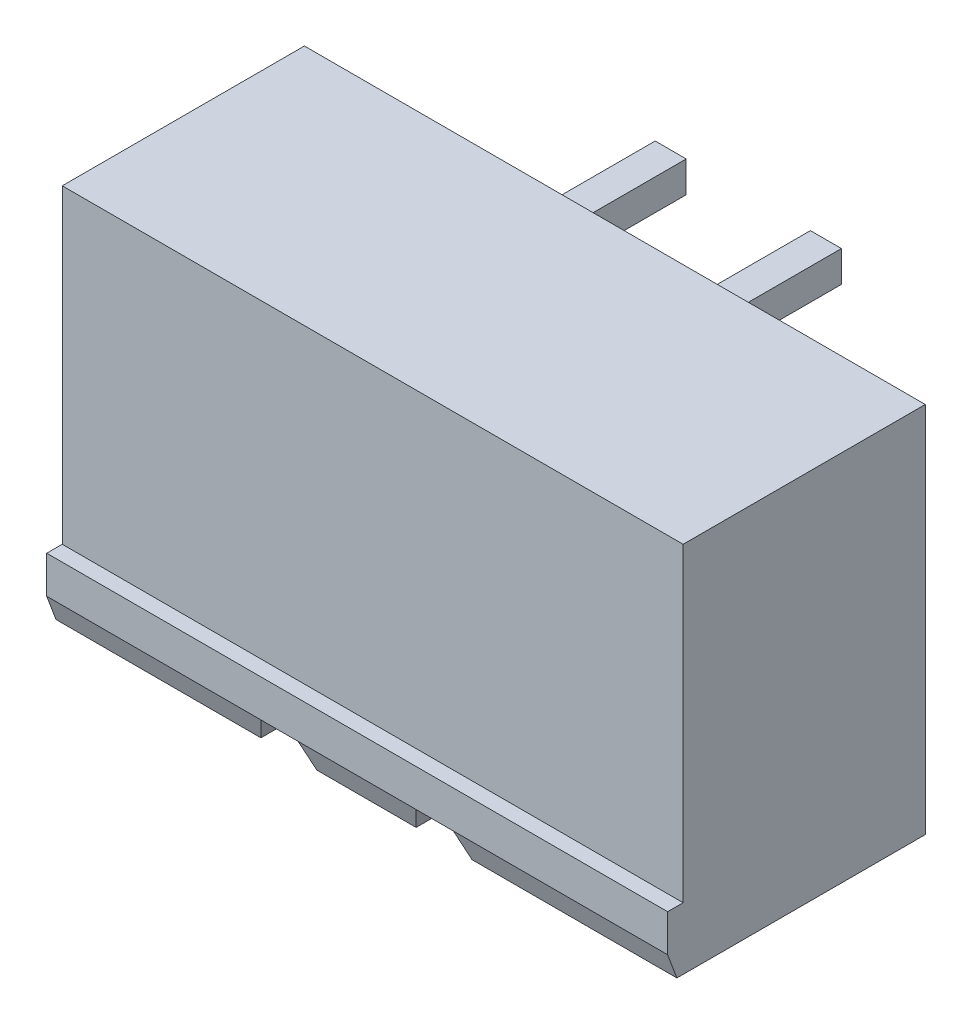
ISO-10303-21;
HEADER;
FILE_DESCRIPTION(('STEP AP214'),'2;1');
FILE_NAME('part.step','',(''),(''),'','','');
FILE_SCHEMA(('AUTOMOTIVE_DESIGN { 1 0 10303 214 1 1 1 1 }'));
ENDSEC;
DATA;
#1=APPLICATION_CONTEXT('core data for automotive mechanical design processes');
#2=APPLICATION_PROTOCOL_DEFINITION('international standard','automotive_design',2000,#1);
#3=PRODUCT_CONTEXT('',#1,'mechanical');
#4=PRODUCT('Part','Part','',(#3));
#5=PRODUCT_RELATED_PRODUCT_CATEGORY('part','',(#4));
#6=PRODUCT_DEFINITION_FORMATION('','',#4);
#7=PRODUCT_DEFINITION_CONTEXT('part definition',#1,'design');
#8=PRODUCT_DEFINITION('design','',#6,#7);
#9=PRODUCT_DEFINITION_SHAPE('','',#8);
#10=(LENGTH_UNIT() NAMED_UNIT(*) SI_UNIT(.MILLI.,.METRE.));
#11=(NAMED_UNIT(*) PLANE_ANGLE_UNIT() SI_UNIT($,.RADIAN.));
#12=(NAMED_UNIT(*) SI_UNIT($,.STERADIAN.) SOLID_ANGLE_UNIT());
#13=UNCERTAINTY_MEASURE_WITH_UNIT(LENGTH_MEASURE(1.E-05),#10,'distance_accuracy_value','');
#14=(GEOMETRIC_REPRESENTATION_CONTEXT(3) GLOBAL_UNCERTAINTY_ASSIGNED_CONTEXT((#13)) GLOBAL_UNIT_ASSIGNED_CONTEXT((#10,
#11,#12)) REPRESENTATION_CONTEXT('',''));
#15=CARTESIAN_POINT('',(0.,0.,0.));
#16=DIRECTION('',(0.,0.,1.));
#17=DIRECTION('',(1.,0.,0.));
#18=AXIS2_PLACEMENT_3D('',#15,#16,#17);
#19=CARTESIAN_POINT('',(12.5,-9.40000000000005,8.29999999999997));
#20=DIRECTION('',(0.,0.351123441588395,-0.936329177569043));
#21=DIRECTION('',(0.,0.936329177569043,0.351123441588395));
#22=AXIS2_PLACEMENT_3D('',#19,#20,#21);
#23=PLANE('',#22);
#24=DIRECTION('',(-1.,0.,0.));
#25=VECTOR('',#24,1.);
#26=CARTESIAN_POINT('',(12.5,-10.2000000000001,7.99999999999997));
#27=LINE('',#26,#25);
#28=CARTESIAN_POINT('',(-0.899999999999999,-10.2,7.99999999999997));
#29=VERTEX_POINT('',#28);
#30=CARTESIAN_POINT('',(-7.5,-10.2000000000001,7.99999999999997));
#31=VERTEX_POINT('',#30);
#32=EDGE_CURVE('E379',#29,#31,#27,.T.);
#33=ORIENTED_EDGE('',*,*,#32,.F.);
#34=DIRECTION('',(0.331294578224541,0.883452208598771,0.331294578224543));
#35=VECTOR('',#34,1.);
#36=CARTESIAN_POINT('',(0.837804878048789,-5.56585365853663,9.73780487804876));
#37=LINE('',#36,#35);
#38=CARTESIAN_POINT('',(-0.599999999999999,-9.40000000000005,8.29999999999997));
#39=VERTEX_POINT('',#38);
#40=EDGE_CURVE('E350',#29,#39,#37,.T.);
#41=ORIENTED_EDGE('',*,*,#40,.T.);
#42=DIRECTION('',(-1.,0.,0.));
#43=VECTOR('',#42,1.);
#44=CARTESIAN_POINT('',(12.5,-9.40000000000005,8.29999999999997));
#45=LINE('',#44,#43);
#46=CARTESIAN_POINT('',(-7.5,-9.40000000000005,8.29999999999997));
#47=VERTEX_POINT('',#46);
#48=EDGE_CURVE('E372',#39,#47,#45,.T.);
#49=ORIENTED_EDGE('',*,*,#48,.T.);
#50=DIRECTION('',(0.,-0.936329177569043,-0.351123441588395));
#51=VECTOR('',#50,1.);
#52=CARTESIAN_POINT('',(-7.5,-9.40000000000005,8.29999999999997));
#53=LINE('',#52,#51);
#54=EDGE_CURVE('E741',#47,#31,#53,.T.);
#55=ORIENTED_EDGE('',*,*,#54,.T.);
#56=EDGE_LOOP('',(#33,#41,#49,#55));
#57=FACE_BOUND('',#56,.T.);
#58=ADVANCED_FACE('F38',(#57),#23,.F.);
#59=CARTESIAN_POINT('',(-7.5,-10.2,0.));
#60=DIRECTION('',(0.,-1.,0.));
#61=DIRECTION('',(1.,0.,0.));
#62=AXIS2_PLACEMENT_3D('',#59,#60,#61);
#63=PLANE('',#62);
#64=DIRECTION('',(0.,0.,1.));
#65=VECTOR('',#64,1.);
#66=CARTESIAN_POINT('',(-0.899999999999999,-10.2,5.03022843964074));
#67=LINE('',#66,#65);
#68=CARTESIAN_POINT('',(-0.899999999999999,-10.2,6.99999999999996));
#69=VERTEX_POINT('',#68);
#70=EDGE_CURVE('E373',#69,#29,#67,.T.);
#71=ORIENTED_EDGE('',*,*,#70,.T.);
#72=ORIENTED_EDGE('',*,*,#32,.T.);
#73=DIRECTION('',(0.,0.,-1.));
#74=VECTOR('',#73,1.);
#75=CARTESIAN_POINT('',(-7.5,-10.2000000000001,8.29999999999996));
#76=LINE('',#75,#74);
#77=CARTESIAN_POINT('',(-7.5,-10.2,0.));
#78=VERTEX_POINT('',#77);
#79=EDGE_CURVE('E558',#31,#78,#76,.T.);
#80=ORIENTED_EDGE('',*,*,#79,.T.);
#81=DIRECTION('',(1.,0.,0.));
#82=VECTOR('',#81,1.);
#83=CARTESIAN_POINT('',(-7.5,-10.2,0.));
#84=LINE('',#83,#82);
#85=CARTESIAN_POINT('',(12.5,-10.2,0.));
#86=VERTEX_POINT('',#85);
#87=EDGE_CURVE('E560',#78,#86,#84,.T.);
#88=ORIENTED_EDGE('',*,*,#87,.T.);
#89=DIRECTION('',(0.,0.,1.));
#90=VECTOR('',#89,1.);
#91=CARTESIAN_POINT('',(12.5,-10.2000000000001,8.29999999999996));
#92=LINE('',#91,#90);
#93=CARTESIAN_POINT('',(12.5,-10.2000000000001,7.99999999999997));
#94=VERTEX_POINT('',#93);
#95=EDGE_CURVE('E563',#86,#94,#92,.T.);
#96=ORIENTED_EDGE('',*,*,#95,.T.);
#97=CARTESIAN_POINT('',(5.9,-10.2,7.99999999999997));
#98=VERTEX_POINT('',#97);
#99=EDGE_CURVE('E383',#94,#98,#27,.T.);
#100=ORIENTED_EDGE('',*,*,#99,.T.);
#101=DIRECTION('',(0.,0.,1.));
#102=VECTOR('',#101,1.);
#103=CARTESIAN_POINT('',(5.9,-10.2,5.03022843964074));
#104=LINE('',#103,#102);
#105=CARTESIAN_POINT('',(5.9,-10.2,6.99999999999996));
#106=VERTEX_POINT('',#105);
#107=EDGE_CURVE('E731',#106,#98,#104,.T.);
#108=ORIENTED_EDGE('',*,*,#107,.F.);
#109=DIRECTION('',(-1.,0.,0.));
#110=VECTOR('',#109,1.);
#111=CARTESIAN_POINT('',(-2.5,-10.2,6.99999999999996));
#112=LINE('',#111,#110);
#113=CARTESIAN_POINT('',(7.5,-10.2,6.99999999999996));
#114=VERTEX_POINT('',#113);
#115=EDGE_CURVE('E483',#114,#106,#112,.T.);
#116=ORIENTED_EDGE('',*,*,#115,.F.);
#117=DIRECTION('',(0.,0.,1.));
#118=VECTOR('',#117,1.);
#119=CARTESIAN_POINT('',(7.5,-10.2,6.99999999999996));
#120=LINE('',#119,#118);
#121=CARTESIAN_POINT('',(7.5,-10.2,1.59999999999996));
#122=VERTEX_POINT('',#121);
#123=EDGE_CURVE('E521',#122,#114,#120,.T.);
#124=ORIENTED_EDGE('',*,*,#123,.F.);
#125=DIRECTION('',(1.,0.,0.));
#126=VECTOR('',#125,1.);
#127=CARTESIAN_POINT('',(7.5,-10.2,1.59999999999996));
#128=LINE('',#127,#126);
#129=CARTESIAN_POINT('',(6.62480768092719,-10.2,1.59999999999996));
#130=VERTEX_POINT('',#129);
#131=EDGE_CURVE('E518',#130,#122,#128,.T.);
#132=ORIENTED_EDGE('',*,*,#131,.F.);
#133=CARTESIAN_POINT('',(5.,-10.2,3.49999999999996));
#134=DIRECTION('',(0.,-1.,0.));
#135=DIRECTION('',(-1.,0.,0.));
#136=AXIS2_PLACEMENT_3D('',#133,#134,#135);
#137=CIRCLE('',#136,2.5);
#138=CARTESIAN_POINT('',(3.37519231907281,-10.2,1.59999999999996));
#139=VERTEX_POINT('',#138);
#140=EDGE_CURVE('E515',#139,#130,#137,.T.);
#141=ORIENTED_EDGE('',*,*,#140,.F.);
#142=DIRECTION('',(1.,0.,0.));
#143=VECTOR('',#142,1.);
#144=CARTESIAN_POINT('',(1.62480768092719,-10.2,1.59999999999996));
#145=LINE('',#144,#143);
#146=CARTESIAN_POINT('',(1.62480768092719,-10.2,1.59999999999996));
#147=VERTEX_POINT('',#146);
#148=EDGE_CURVE('E512',#147,#139,#145,.T.);
#149=ORIENTED_EDGE('',*,*,#148,.F.);
#150=CARTESIAN_POINT('',(0.,-10.2,3.49999999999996));
#151=DIRECTION('',(0.,-1.,0.));
#152=DIRECTION('',(1.,0.,0.));
#153=AXIS2_PLACEMENT_3D('',#150,#151,#152);
#154=CIRCLE('',#153,2.5);
#155=CARTESIAN_POINT('',(-1.62480768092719,-10.2,1.59999999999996));
#156=VERTEX_POINT('',#155);
#157=EDGE_CURVE('E509',#156,#147,#154,.T.);
#158=ORIENTED_EDGE('',*,*,#157,.F.);
#159=DIRECTION('',(1.,0.,0.));
#160=VECTOR('',#159,1.);
#161=CARTESIAN_POINT('',(-2.5,-10.2,1.59999999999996));
#162=LINE('',#161,#160);
#163=CARTESIAN_POINT('',(-2.5,-10.2,1.59999999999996));
#164=VERTEX_POINT('',#163);
#165=EDGE_CURVE('E506',#164,#156,#162,.T.);
#166=ORIENTED_EDGE('',*,*,#165,.F.);
#167=DIRECTION('',(0.,0.,-1.));
#168=VECTOR('',#167,1.);
#169=CARTESIAN_POINT('',(-2.5,-10.2,6.99999999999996));
#170=LINE('',#169,#168);
#171=CARTESIAN_POINT('',(-2.5,-10.2,6.99999999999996));
#172=VERTEX_POINT('',#171);
#173=EDGE_CURVE('E476',#172,#164,#170,.T.);
#174=ORIENTED_EDGE('',*,*,#173,.F.);
#175=EDGE_CURVE('E524',#69,#172,#112,.T.);
#176=ORIENTED_EDGE('',*,*,#175,.F.);
#177=EDGE_LOOP('',(#71,#72,#80,#88,#96,#100,#108,#116,#124,#132,#141,#149,#158,#166,#174,#176));
#178=FACE_BOUND('',#177,.T.);
#179=CARTESIAN_POINT('',(10.,-10.2,3.99999999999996));
#180=DIRECTION('',(0.,-1.,0.));
#181=DIRECTION('',(1.,0.,0.));
#182=AXIS2_PLACEMENT_3D('',#179,#180,#181);
#183=CIRCLE('',#182,1.02499999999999);
#184=CARTESIAN_POINT('',(11.025,-10.2,3.99999999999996));
#185=VERTEX_POINT('',#184);
#186=EDGE_CURVE('E551',#185,#185,#183,.T.);
#187=ORIENTED_EDGE('',*,*,#186,.F.);
#188=EDGE_LOOP('',(#187));
#189=FACE_BOUND('',#188,.T.);
#190=CARTESIAN_POINT('',(-5.,-10.2,3.99999999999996));
#191=DIRECTION('',(0.,-1.,0.));
#192=DIRECTION('',(1.,0.,0.));
#193=AXIS2_PLACEMENT_3D('',#190,#191,#192);
#194=CIRCLE('',#193,1.02499999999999);
#195=CARTESIAN_POINT('',(-3.97500000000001,-10.2,3.99999999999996));
#196=VERTEX_POINT('',#195);
#197=EDGE_CURVE('E531',#196,#196,#194,.T.);
#198=ORIENTED_EDGE('',*,*,#197,.F.);
#199=EDGE_LOOP('',(#198));
#200=FACE_BOUND('',#199,.T.);
#201=ADVANCED_FACE('F728',(#178,#189,#200),#63,.T.);
#202=CARTESIAN_POINT('',(4.4,-9.40000000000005,8.29999999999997));
#203=VERTEX_POINT('',#202);
#204=CARTESIAN_POINT('',(0.600000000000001,-9.40000000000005,8.29999999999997));
#205=VERTEX_POINT('',#204);
#206=EDGE_CURVE('E371',#203,#205,#45,.T.);
#207=ORIENTED_EDGE('',*,*,#206,.T.);
#208=DIRECTION('',(0.331294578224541,-0.883452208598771,-0.331294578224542));
#209=VECTOR('',#208,1.);
#210=CARTESIAN_POINT('',(1.90609756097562,-12.8829268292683,6.99390243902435));
#211=LINE('',#210,#209);
#212=CARTESIAN_POINT('',(0.900000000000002,-10.2,7.99999999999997));
#213=VERTEX_POINT('',#212);
#214=EDGE_CURVE('E342',#205,#213,#211,.T.);
#215=ORIENTED_EDGE('',*,*,#214,.T.);
#216=CARTESIAN_POINT('',(4.1,-10.2000000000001,7.99999999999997));
#217=VERTEX_POINT('',#216);
#218=EDGE_CURVE('E733',#217,#213,#27,.T.);
#219=ORIENTED_EDGE('',*,*,#218,.F.);
#220=DIRECTION('',(0.331294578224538,0.883452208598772,0.331294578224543));
#221=VECTOR('',#220,1.);
#222=CARTESIAN_POINT('',(5.28902439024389,-7.02926829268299,9.18902439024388));
#223=LINE('',#222,#221);
#224=EDGE_CURVE('E11',#217,#203,#223,.T.);
#225=ORIENTED_EDGE('',*,*,#224,.T.);
#226=EDGE_LOOP('',(#207,#215,#219,#225));
#227=FACE_BOUND('',#226,.T.);
#228=ADVANCED_FACE('F375',(#227),#23,.F.);
#229=CARTESIAN_POINT('',(-7.5,1.79999999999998,0.));
#230=DIRECTION('',(0.,-1.,0.));
#231=DIRECTION('',(1.,0.,0.));
#232=AXIS2_PLACEMENT_3D('',#229,#230,#231);
#233=PLANE('',#232);
#234=DIRECTION('',(-1.,0.,0.));
#235=VECTOR('',#234,1.);
#236=CARTESIAN_POINT('',(-7.49999999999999,1.79999999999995,7.80000000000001));
#237=LINE('',#236,#235);
#238=CARTESIAN_POINT('',(12.5,1.79999999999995,7.80000000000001));
#239=VERTEX_POINT('',#238);
#240=CARTESIAN_POINT('',(-7.49999999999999,1.79999999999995,7.80000000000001));
#241=VERTEX_POINT('',#240);
#242=EDGE_CURVE('E394',#239,#241,#237,.T.);
#243=ORIENTED_EDGE('',*,*,#242,.F.);
#244=DIRECTION('',(0.,0.,1.));
#245=VECTOR('',#244,1.);
#246=CARTESIAN_POINT('',(12.5,1.79999999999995,8.30000000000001));
#247=LINE('',#246,#245);
#248=CARTESIAN_POINT('',(12.5,1.79999999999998,0.));
#249=VERTEX_POINT('',#248);
#250=EDGE_CURVE('E561',#249,#239,#247,.T.);
#251=ORIENTED_EDGE('',*,*,#250,.F.);
#252=DIRECTION('',(1.,0.,0.));
#253=VECTOR('',#252,1.);
#254=CARTESIAN_POINT('',(-7.5,1.79999999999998,0.));
#255=LINE('',#254,#253);
#256=CARTESIAN_POINT('',(-7.5,1.79999999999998,0.));
#257=VERTEX_POINT('',#256);
#258=EDGE_CURVE('E568',#257,#249,#255,.T.);
#259=ORIENTED_EDGE('',*,*,#258,.F.);
#260=DIRECTION('',(0.,0.,-1.));
#261=VECTOR('',#260,1.);
#262=CARTESIAN_POINT('',(-7.5,1.79999999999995,8.30000000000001));
#263=LINE('',#262,#261);
#264=EDGE_CURVE('E557',#241,#257,#263,.T.);
#265=ORIENTED_EDGE('',*,*,#264,.F.);
#266=EDGE_LOOP('',(#243,#251,#259,#265));
#267=FACE_BOUND('',#266,.T.);
#268=ADVANCED_FACE('F839',(#267),#233,.F.);
#269=CARTESIAN_POINT('',(0.,-2.20000000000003,3.49999999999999));
#270=DIRECTION('',(0.,-1.,0.));
#271=DIRECTION('',(1.,0.,0.));
#272=AXIS2_PLACEMENT_3D('',#269,#270,#271);
#273=PLANE('',#272);
#274=CARTESIAN_POINT('',(0.,-2.20000000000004,3.99999999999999));
#275=DIRECTION('',(0.,-1.,0.));
#276=DIRECTION('',(1.,0.,0.));
#277=AXIS2_PLACEMENT_3D('',#274,#275,#276);
#278=CIRCLE('',#277,1.5);
#279=CARTESIAN_POINT('',(1.5,-2.20000000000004,3.99999999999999));
#280=VERTEX_POINT('',#279);
#281=EDGE_CURVE('E470',#280,#280,#278,.T.);
#282=ORIENTED_EDGE('',*,*,#281,.F.);
#283=EDGE_LOOP('',(#282));
#284=FACE_BOUND('',#283,.T.);
#285=DIRECTION('',(0.,0.,-1.));
#286=VECTOR('',#285,1.);
#287=CARTESIAN_POINT('',(-2.5,-2.20000000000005,6.99999999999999));
#288=LINE('',#287,#286);
#289=CARTESIAN_POINT('',(-2.5,-2.20000000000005,6.99999999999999));
#290=VERTEX_POINT('',#289);
#291=CARTESIAN_POINT('',(-2.5,-2.20000000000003,1.59999999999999));
#292=VERTEX_POINT('',#291);
#293=EDGE_CURVE('E479',#290,#292,#288,.T.);
#294=ORIENTED_EDGE('',*,*,#293,.T.);
#295=DIRECTION('',(1.,0.,0.));
#296=VECTOR('',#295,1.);
#297=CARTESIAN_POINT('',(-2.5,-2.20000000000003,1.59999999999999));
#298=LINE('',#297,#296);
#299=CARTESIAN_POINT('',(-1.62480768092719,-2.20000000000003,1.59999999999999));
#300=VERTEX_POINT('',#299);
#301=EDGE_CURVE('E482',#292,#300,#298,.T.);
#302=ORIENTED_EDGE('',*,*,#301,.T.);
#303=CARTESIAN_POINT('',(0.,-2.20000000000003,3.49999999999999));
#304=DIRECTION('',(0.,-1.,0.));
#305=DIRECTION('',(1.,0.,0.));
#306=AXIS2_PLACEMENT_3D('',#303,#304,#305);
#307=CIRCLE('',#306,2.5);
#308=CARTESIAN_POINT('',(1.62480768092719,-2.20000000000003,1.59999999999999));
#309=VERTEX_POINT('',#308);
#310=EDGE_CURVE('E486',#300,#309,#307,.T.);
#311=ORIENTED_EDGE('',*,*,#310,.T.);
#312=DIRECTION('',(1.,0.,0.));
#313=VECTOR('',#312,1.);
#314=CARTESIAN_POINT('',(1.62480768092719,-2.20000000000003,1.59999999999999));
#315=LINE('',#314,#313);
#316=CARTESIAN_POINT('',(3.37519231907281,-2.20000000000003,1.59999999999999));
#317=VERTEX_POINT('',#316);
#318=EDGE_CURVE('E489',#309,#317,#315,.T.);
#319=ORIENTED_EDGE('',*,*,#318,.T.);
#320=CARTESIAN_POINT('',(5.,-2.20000000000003,3.49999999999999));
#321=DIRECTION('',(0.,-1.,0.));
#322=DIRECTION('',(-1.,0.,0.));
#323=AXIS2_PLACEMENT_3D('',#320,#321,#322);
#324=CIRCLE('',#323,2.5);
#325=CARTESIAN_POINT('',(6.62480768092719,-2.20000000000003,1.59999999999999));
#326=VERTEX_POINT('',#325);
#327=EDGE_CURVE('E492',#317,#326,#324,.T.);
#328=ORIENTED_EDGE('',*,*,#327,.T.);
#329=DIRECTION('',(1.,0.,0.));
#330=VECTOR('',#329,1.);
#331=CARTESIAN_POINT('',(7.5,-2.20000000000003,1.59999999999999));
#332=LINE('',#331,#330);
#333=CARTESIAN_POINT('',(7.5,-2.20000000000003,1.59999999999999));
#334=VERTEX_POINT('',#333);
#335=EDGE_CURVE('E495',#326,#334,#332,.T.);
#336=ORIENTED_EDGE('',*,*,#335,.T.);
#337=DIRECTION('',(0.,0.,1.));
#338=VECTOR('',#337,1.);
#339=CARTESIAN_POINT('',(7.5,-2.20000000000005,6.99999999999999));
#340=LINE('',#339,#338);
#341=CARTESIAN_POINT('',(7.5,-2.20000000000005,6.99999999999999));
#342=VERTEX_POINT('',#341);
#343=EDGE_CURVE('E498',#334,#342,#340,.T.);
#344=ORIENTED_EDGE('',*,*,#343,.T.);
#345=DIRECTION('',(-1.,0.,0.));
#346=VECTOR('',#345,1.);
#347=CARTESIAN_POINT('',(-2.5,-2.20000000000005,6.99999999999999));
#348=LINE('',#347,#346);
#349=EDGE_CURVE('E501',#342,#290,#348,.T.);
#350=ORIENTED_EDGE('',*,*,#349,.T.);
#351=EDGE_LOOP('',(#294,#302,#311,#319,#328,#336,#344,#350));
#352=FACE_BOUND('',#351,.T.);
#353=CARTESIAN_POINT('',(5.,-2.20000000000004,3.99999999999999));
#354=DIRECTION('',(0.,-1.,0.));
#355=DIRECTION('',(-1.,0.,0.));
#356=AXIS2_PLACEMENT_3D('',#353,#354,#355);
#357=CIRCLE('',#356,1.5);
#358=CARTESIAN_POINT('',(3.5,-2.20000000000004,3.99999999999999));
#359=VERTEX_POINT('',#358);
#360=EDGE_CURVE('E466',#359,#359,#357,.T.);
#361=ORIENTED_EDGE('',*,*,#360,.F.);
#362=EDGE_LOOP('',(#361));
#363=FACE_BOUND('',#362,.T.);
#364=ADVANCED_FACE('F801',(#284,#352,#363),#273,.T.);
#365=CARTESIAN_POINT('',(-7.5,-10.2000000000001,8.29999999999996));
#366=DIRECTION('',(1.,0.,0.));
#367=DIRECTION('',(0.,0.,1.));
#368=AXIS2_PLACEMENT_3D('',#365,#366,#367);
#369=PLANE('',#368);
#370=ORIENTED_EDGE('',*,*,#79,.F.);
#371=ORIENTED_EDGE('',*,*,#54,.F.);
#372=DIRECTION('',(0.,1.,0.));
#373=VECTOR('',#372,1.);
#374=CARTESIAN_POINT('',(-7.5,-10.2000000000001,8.29999999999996));
#375=LINE('',#374,#373);
#376=CARTESIAN_POINT('',(-7.49999999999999,-8.20000000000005,8.29999999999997));
#377=VERTEX_POINT('',#376);
#378=EDGE_CURVE('E566',#47,#377,#375,.T.);
#379=ORIENTED_EDGE('',*,*,#378,.T.);
#380=DIRECTION('',(0.,0.,1.));
#381=VECTOR('',#380,1.);
#382=CARTESIAN_POINT('',(-7.49999999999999,-8.20000000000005,7.79999999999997));
#383=LINE('',#382,#381);
#384=CARTESIAN_POINT('',(-7.49999999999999,-8.20000000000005,7.79999999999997));
#385=VERTEX_POINT('',#384);
#386=EDGE_CURVE('E396',#385,#377,#383,.T.);
#387=ORIENTED_EDGE('',*,*,#386,.F.);
#388=DIRECTION('',(0.,-1.,0.));
#389=VECTOR('',#388,1.);
#390=CARTESIAN_POINT('',(-7.49999999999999,1.79999999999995,7.80000000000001));
#391=LINE('',#390,#389);
#392=EDGE_CURVE('E385',#241,#385,#391,.T.);
#393=ORIENTED_EDGE('',*,*,#392,.F.);
#394=ORIENTED_EDGE('',*,*,#264,.T.);
#395=DIRECTION('',(0.,1.,0.));
#396=VECTOR('',#395,1.);
#397=CARTESIAN_POINT('',(-7.5,-10.2,0.));
#398=LINE('',#397,#396);
#399=EDGE_CURVE('E578',#78,#257,#398,.T.);
#400=ORIENTED_EDGE('',*,*,#399,.F.);
#401=EDGE_LOOP('',(#370,#371,#379,#387,#393,#394,#400));
#402=FACE_BOUND('',#401,.T.);
#403=ADVANCED_FACE('F745',(#402),#369,.F.);
#404=CARTESIAN_POINT('',(-7.5,-10.2,0.));
#405=DIRECTION('',(0.,0.,1.));
#406=DIRECTION('',(0.,-1.,0.));
#407=AXIS2_PLACEMENT_3D('',#404,#405,#406);
#408=PLANE('',#407);
#409=DIRECTION('',(-1.,0.,0.));
#410=VECTOR('',#409,1.);
#411=CARTESIAN_POINT('',(-7.5,-0.500000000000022,0.));
#412=LINE('',#411,#410);
#413=CARTESIAN_POINT('',(0.5,-0.500000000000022,0.));
#414=VERTEX_POINT('',#413);
#415=CARTESIAN_POINT('',(-0.5,-0.500000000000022,0.));
#416=VERTEX_POINT('',#415);
#417=EDGE_CURVE('E662',#414,#416,#412,.T.);
#418=ORIENTED_EDGE('',*,*,#417,.F.);
#419=DIRECTION('',(0.,1.,0.));
#420=VECTOR('',#419,1.);
#421=CARTESIAN_POINT('',(0.5,-10.2,0.));
#422=LINE('',#421,#420);
#423=CARTESIAN_POINT('',(0.5,0.499999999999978,0.));
#424=VERTEX_POINT('',#423);
#425=EDGE_CURVE('E433',#414,#424,#422,.T.);
#426=ORIENTED_EDGE('',*,*,#425,.T.);
#427=DIRECTION('',(-1.,0.,0.));
#428=VECTOR('',#427,1.);
#429=CARTESIAN_POINT('',(-7.5,0.499999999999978,0.));
#430=LINE('',#429,#428);
#431=CARTESIAN_POINT('',(-0.5,0.499999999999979,0.));
#432=VERTEX_POINT('',#431);
#433=EDGE_CURVE('E660',#424,#432,#430,.T.);
#434=ORIENTED_EDGE('',*,*,#433,.T.);
#435=DIRECTION('',(0.,1.,0.));
#436=VECTOR('',#435,1.);
#437=CARTESIAN_POINT('',(-0.5,-10.2,0.));
#438=LINE('',#437,#436);
#439=EDGE_CURVE('E418',#416,#432,#438,.T.);
#440=ORIENTED_EDGE('',*,*,#439,.F.);
#441=EDGE_LOOP('',(#418,#426,#434,#440));
#442=FACE_BOUND('',#441,.T.);
#443=DIRECTION('',(-1.,0.,0.));
#444=VECTOR('',#443,1.);
#445=CARTESIAN_POINT('',(-7.5,-0.500000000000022,0.));
#446=LINE('',#445,#444);
#447=CARTESIAN_POINT('',(5.5,-0.500000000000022,0.));
#448=VERTEX_POINT('',#447);
#449=CARTESIAN_POINT('',(4.5,-0.500000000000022,0.));
#450=VERTEX_POINT('',#449);
#451=EDGE_CURVE('E593',#448,#450,#446,.T.);
#452=ORIENTED_EDGE('',*,*,#451,.F.);
#453=DIRECTION('',(0.,1.,0.));
#454=VECTOR('',#453,1.);
#455=CARTESIAN_POINT('',(5.5,-10.2,0.));
#456=LINE('',#455,#454);
#457=CARTESIAN_POINT('',(5.5,0.499999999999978,0.));
#458=VERTEX_POINT('',#457);
#459=EDGE_CURVE('E464',#448,#458,#456,.T.);
#460=ORIENTED_EDGE('',*,*,#459,.T.);
#461=DIRECTION('',(-1.,0.,0.));
#462=VECTOR('',#461,1.);
#463=CARTESIAN_POINT('',(-7.5,0.499999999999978,0.));
#464=LINE('',#463,#462);
#465=CARTESIAN_POINT('',(4.5,0.499999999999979,0.));
#466=VERTEX_POINT('',#465);
#467=EDGE_CURVE('E591',#458,#466,#464,.T.);
#468=ORIENTED_EDGE('',*,*,#467,.T.);
#469=DIRECTION('',(0.,1.,0.));
#470=VECTOR('',#469,1.);
#471=CARTESIAN_POINT('',(4.5,-10.2,0.));
#472=LINE('',#471,#470);
#473=EDGE_CURVE('E449',#450,#466,#472,.T.);
#474=ORIENTED_EDGE('',*,*,#473,.F.);
#475=EDGE_LOOP('',(#452,#460,#468,#474));
#476=FACE_BOUND('',#475,.T.);
#477=ORIENTED_EDGE('',*,*,#258,.T.);
#478=DIRECTION('',(0.,1.,0.));
#479=VECTOR('',#478,1.);
#480=CARTESIAN_POINT('',(12.5,-10.2,0.));
#481=LINE('',#480,#479);
#482=EDGE_CURVE('E575',#86,#249,#481,.T.);
#483=ORIENTED_EDGE('',*,*,#482,.F.);
#484=ORIENTED_EDGE('',*,*,#87,.F.);
#485=ORIENTED_EDGE('',*,*,#399,.T.);
#486=EDGE_LOOP('',(#477,#483,#484,#485));
#487=FACE_BOUND('',#486,.T.);
#488=ADVANCED_FACE('F750',(#442,#476,#487),#408,.F.);
#489=CARTESIAN_POINT('',(12.5,-10.2000000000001,8.29999999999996));
#490=DIRECTION('',(-1.,0.,0.));
#491=DIRECTION('',(0.,0.,-1.));
#492=AXIS2_PLACEMENT_3D('',#489,#490,#491);
#493=PLANE('',#492);
#494=DIRECTION('',(0.,1.,0.));
#495=VECTOR('',#494,1.);
#496=CARTESIAN_POINT('',(12.5,-10.2000000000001,8.29999999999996));
#497=LINE('',#496,#495);
#498=CARTESIAN_POINT('',(12.5,-9.40000000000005,8.29999999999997));
#499=VERTEX_POINT('',#498);
#500=CARTESIAN_POINT('',(12.5,-8.20000000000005,8.29999999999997));
#501=VERTEX_POINT('',#500);
#502=EDGE_CURVE('E573',#499,#501,#497,.T.);
#503=ORIENTED_EDGE('',*,*,#502,.F.);
#504=DIRECTION('',(0.,-0.936329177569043,-0.351123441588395));
#505=VECTOR('',#504,1.);
#506=CARTESIAN_POINT('',(12.5,-9.40000000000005,8.29999999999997));
#507=LINE('',#506,#505);
#508=EDGE_CURVE('E380',#499,#94,#507,.T.);
#509=ORIENTED_EDGE('',*,*,#508,.T.);
#510=ORIENTED_EDGE('',*,*,#95,.F.);
#511=ORIENTED_EDGE('',*,*,#482,.T.);
#512=ORIENTED_EDGE('',*,*,#250,.T.);
#513=DIRECTION('',(0.,1.,0.));
#514=VECTOR('',#513,1.);
#515=CARTESIAN_POINT('',(12.5,1.79999999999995,7.80000000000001));
#516=LINE('',#515,#514);
#517=CARTESIAN_POINT('',(12.5,-8.20000000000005,7.79999999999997));
#518=VERTEX_POINT('',#517);
#519=EDGE_CURVE('E392',#518,#239,#516,.T.);
#520=ORIENTED_EDGE('',*,*,#519,.F.);
#521=DIRECTION('',(0.,0.,1.));
#522=VECTOR('',#521,1.);
#523=CARTESIAN_POINT('',(12.5,-8.20000000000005,7.79999999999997));
#524=LINE('',#523,#522);
#525=EDGE_CURVE('E399',#518,#501,#524,.T.);
#526=ORIENTED_EDGE('',*,*,#525,.T.);
#527=EDGE_LOOP('',(#503,#509,#510,#511,#512,#520,#526));
#528=FACE_BOUND('',#527,.T.);
#529=ADVANCED_FACE('F755',(#528),#493,.F.);
#530=CARTESIAN_POINT('',(-7.5,-10.2000000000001,8.29999999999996));
#531=DIRECTION('',(0.,0.,-1.));
#532=DIRECTION('',(0.,1.,0.));
#533=AXIS2_PLACEMENT_3D('',#530,#531,#532);
#534=PLANE('',#533);
#535=ORIENTED_EDGE('',*,*,#378,.F.);
#536=ORIENTED_EDGE('',*,*,#48,.F.);
#537=DIRECTION('',(-1.,0.,0.));
#538=VECTOR('',#537,1.);
#539=CARTESIAN_POINT('',(-0.599999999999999,-9.40000000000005,8.29999999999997));
#540=LINE('',#539,#538);
#541=EDGE_CURVE('E358',#205,#39,#540,.T.);
#542=ORIENTED_EDGE('',*,*,#541,.F.);
#543=ORIENTED_EDGE('',*,*,#206,.F.);
#544=DIRECTION('',(-1.,0.,0.));
#545=VECTOR('',#544,1.);
#546=CARTESIAN_POINT('',(5.6,-9.40000000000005,8.29999999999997));
#547=LINE('',#546,#545);
#548=CARTESIAN_POINT('',(5.6,-9.40000000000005,8.29999999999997));
#549=VERTEX_POINT('',#548);
#550=EDGE_CURVE('E761',#549,#203,#547,.T.);
#551=ORIENTED_EDGE('',*,*,#550,.F.);
#552=EDGE_CURVE('E376',#499,#549,#45,.T.);
#553=ORIENTED_EDGE('',*,*,#552,.F.);
#554=ORIENTED_EDGE('',*,*,#502,.T.);
#555=DIRECTION('',(1.,0.,0.));
#556=VECTOR('',#555,1.);
#557=CARTESIAN_POINT('',(-7.49999999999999,-8.20000000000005,8.29999999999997));
#558=LINE('',#557,#556);
#559=EDGE_CURVE('E389',#377,#501,#558,.T.);
#560=ORIENTED_EDGE('',*,*,#559,.F.);
#561=EDGE_LOOP('',(#535,#536,#542,#543,#551,#553,#554,#560));
#562=FACE_BOUND('',#561,.T.);
#563=ADVANCED_FACE('F369',(#562),#534,.F.);
#564=DIRECTION('',(0.,0.,1.));
#565=VECTOR('',#564,1.);
#566=CARTESIAN_POINT('',(0.900000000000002,-10.2,5.03022843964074));
#567=LINE('',#566,#565);
#568=CARTESIAN_POINT('',(0.900000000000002,-10.2,6.99999999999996));
#569=VERTEX_POINT('',#568);
#570=EDGE_CURVE('E345',#569,#213,#567,.T.);
#571=ORIENTED_EDGE('',*,*,#570,.F.);
#572=CARTESIAN_POINT('',(4.1,-10.2,6.99999999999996));
#573=VERTEX_POINT('',#572);
#574=EDGE_CURVE('E527',#573,#569,#112,.T.);
#575=ORIENTED_EDGE('',*,*,#574,.F.);
#576=DIRECTION('',(0.,0.,1.));
#577=VECTOR('',#576,1.);
#578=CARTESIAN_POINT('',(4.1,-10.2,5.03022843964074));
#579=LINE('',#578,#577);
#580=EDGE_CURVE('E765',#573,#217,#579,.T.);
#581=ORIENTED_EDGE('',*,*,#580,.T.);
#582=ORIENTED_EDGE('',*,*,#218,.T.);
#583=EDGE_LOOP('',(#571,#575,#581,#582));
#584=FACE_BOUND('',#583,.T.);
#585=ADVANCED_FACE('F783',(#584),#63,.T.);
#586=CARTESIAN_POINT('',(10.,-3.65000000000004,3.99999999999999));
#587=DIRECTION('',(0.,-1.,0.));
#588=DIRECTION('',(1.,0.,0.));
#589=AXIS2_PLACEMENT_3D('',#586,#587,#588);
#590=CONICAL_SURFACE('',#589,1.02499999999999,1.02974425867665);
#591=CARTESIAN_POINT('',(10.,-3.03411786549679,3.99999999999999));
#592=VERTEX_POINT('',#591);
#593=VERTEX_LOOP('',#592);
#594=FACE_BOUND('',#593,.T.);
#595=CARTESIAN_POINT('',(10.,-3.65000000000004,3.99999999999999));
#596=DIRECTION('',(0.,-1.,0.));
#597=DIRECTION('',(1.,0.,0.));
#598=AXIS2_PLACEMENT_3D('',#595,#596,#597);
#599=CIRCLE('',#598,1.02499999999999);
#600=CARTESIAN_POINT('',(11.025,-3.65000000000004,3.99999999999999));
#601=VERTEX_POINT('',#600);
#602=EDGE_CURVE('E554',#601,#601,#599,.T.);
#603=ORIENTED_EDGE('',*,*,#602,.T.);
#604=EDGE_LOOP('',(#603));
#605=FACE_BOUND('',#604,.T.);
#606=ADVANCED_FACE('F1396',(#594,#605),#590,.F.);
#607=CARTESIAN_POINT('',(10.,-10.2,3.99999999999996));
#608=DIRECTION('',(0.,-1.,0.));
#609=DIRECTION('',(1.,0.,0.));
#610=AXIS2_PLACEMENT_3D('',#607,#608,#609);
#611=CYLINDRICAL_SURFACE('',#610,1.02499999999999);
#612=ORIENTED_EDGE('',*,*,#602,.F.);
#613=EDGE_LOOP('',(#612));
#614=FACE_BOUND('',#613,.T.);
#615=ORIENTED_EDGE('',*,*,#186,.T.);
#616=EDGE_LOOP('',(#615));
#617=FACE_BOUND('',#616,.T.);
#618=ADVANCED_FACE('F1402',(#614,#617),#611,.F.);
#619=CARTESIAN_POINT('',(-5.,-3.65000000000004,3.99999999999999));
#620=DIRECTION('',(0.,-1.,0.));
#621=DIRECTION('',(1.,0.,0.));
#622=AXIS2_PLACEMENT_3D('',#619,#620,#621);
#623=CONICAL_SURFACE('',#622,1.02499999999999,1.02974425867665);
#624=CARTESIAN_POINT('',(-5.,-3.03411786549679,3.99999999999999));
#625=VERTEX_POINT('',#624);
#626=VERTEX_LOOP('',#625);
#627=FACE_BOUND('',#626,.T.);
#628=CARTESIAN_POINT('',(-5.,-3.65000000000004,3.99999999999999));
#629=DIRECTION('',(0.,-1.,0.));
#630=DIRECTION('',(1.,0.,0.));
#631=AXIS2_PLACEMENT_3D('',#628,#629,#630);
#632=CIRCLE('',#631,1.02499999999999);
#633=CARTESIAN_POINT('',(-3.97500000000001,-3.65000000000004,3.99999999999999));
#634=VERTEX_POINT('',#633);
#635=EDGE_CURVE('E548',#634,#634,#632,.T.);
#636=ORIENTED_EDGE('',*,*,#635,.T.);
#637=EDGE_LOOP('',(#636));
#638=FACE_BOUND('',#637,.T.);
#639=ADVANCED_FACE('F1410',(#627,#638),#623,.F.);
#640=CARTESIAN_POINT('',(-5.,-10.2,3.99999999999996));
#641=DIRECTION('',(0.,-1.,0.));
#642=DIRECTION('',(1.,0.,0.));
#643=AXIS2_PLACEMENT_3D('',#640,#641,#642);
#644=CYLINDRICAL_SURFACE('',#643,1.02499999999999);
#645=ORIENTED_EDGE('',*,*,#635,.F.);
#646=EDGE_LOOP('',(#645));
#647=FACE_BOUND('',#646,.T.);
#648=ORIENTED_EDGE('',*,*,#197,.T.);
#649=EDGE_LOOP('',(#648));
#650=FACE_BOUND('',#649,.T.);
#651=ADVANCED_FACE('F1418',(#647,#650),#644,.F.);
#652=CARTESIAN_POINT('',(-2.5,-2.20000000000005,6.99999999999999));
#653=DIRECTION('',(-1.,0.,0.));
#654=DIRECTION('',(0.,0.,-1.));
#655=AXIS2_PLACEMENT_3D('',#652,#653,#654);
#656=PLANE('',#655);
#657=ORIENTED_EDGE('',*,*,#173,.T.);
#658=DIRECTION('',(0.,-1.,0.));
#659=VECTOR('',#658,1.);
#660=CARTESIAN_POINT('',(-2.5,-2.20000000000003,1.59999999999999));
#661=LINE('',#660,#659);
#662=EDGE_CURVE('E504',#292,#164,#661,.T.);
#663=ORIENTED_EDGE('',*,*,#662,.F.);
#664=ORIENTED_EDGE('',*,*,#293,.F.);
#665=DIRECTION('',(0.,-1.,0.));
#666=VECTOR('',#665,1.);
#667=CARTESIAN_POINT('',(-2.5,-2.20000000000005,6.99999999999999));
#668=LINE('',#667,#666);
#669=EDGE_CURVE('E528',#290,#172,#668,.T.);
#670=ORIENTED_EDGE('',*,*,#669,.T.);
#671=EDGE_LOOP('',(#657,#663,#664,#670));
#672=FACE_BOUND('',#671,.T.);
#673=ADVANCED_FACE('F792',(#672),#656,.F.);
#674=CARTESIAN_POINT('',(-2.5,-2.20000000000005,6.99999999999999));
#675=DIRECTION('',(0.,0.,1.));
#676=DIRECTION('',(-1.,0.,0.));
#677=AXIS2_PLACEMENT_3D('',#674,#675,#676);
#678=PLANE('',#677);
#679=DIRECTION('',(1.,0.,0.));
#680=VECTOR('',#679,1.);
#681=CARTESIAN_POINT('',(-0.599999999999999,-9.40000000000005,6.99999999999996));
#682=LINE('',#681,#680);
#683=CARTESIAN_POINT('',(-0.599999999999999,-9.40000000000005,6.99999999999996));
#684=VERTEX_POINT('',#683);
#685=CARTESIAN_POINT('',(0.600000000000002,-9.40000000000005,6.99999999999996));
#686=VERTEX_POINT('',#685);
#687=EDGE_CURVE('E361',#684,#686,#682,.T.);
#688=ORIENTED_EDGE('',*,*,#687,.F.);
#689=DIRECTION('',(0.351123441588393,0.936329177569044,0.));
#690=VECTOR('',#689,1.);
#691=CARTESIAN_POINT('',(-0.899999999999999,-10.2,6.99999999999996));
#692=LINE('',#691,#690);
#693=EDGE_CURVE('E351',#69,#684,#692,.T.);
#694=ORIENTED_EDGE('',*,*,#693,.F.);
#695=ORIENTED_EDGE('',*,*,#175,.T.);
#696=ORIENTED_EDGE('',*,*,#669,.F.);
#697=ORIENTED_EDGE('',*,*,#349,.F.);
#698=DIRECTION('',(0.,-1.,0.));
#699=VECTOR('',#698,1.);
#700=CARTESIAN_POINT('',(7.5,-2.20000000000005,6.99999999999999));
#701=LINE('',#700,#699);
#702=EDGE_CURVE('E532',#342,#114,#701,.T.);
#703=ORIENTED_EDGE('',*,*,#702,.T.);
#704=ORIENTED_EDGE('',*,*,#115,.T.);
#705=DIRECTION('',(0.351123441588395,-0.936329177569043,0.));
#706=VECTOR('',#705,1.);
#707=CARTESIAN_POINT('',(5.9,-10.2,6.99999999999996));
#708=LINE('',#707,#706);
#709=CARTESIAN_POINT('',(5.6,-9.40000000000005,6.99999999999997));
#710=VERTEX_POINT('',#709);
#711=EDGE_CURVE('E743',#710,#106,#708,.T.);
#712=ORIENTED_EDGE('',*,*,#711,.F.);
#713=DIRECTION('',(1.,0.,0.));
#714=VECTOR('',#713,1.);
#715=CARTESIAN_POINT('',(5.6,-9.40000000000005,6.99999999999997));
#716=LINE('',#715,#714);
#717=CARTESIAN_POINT('',(4.4,-9.40000000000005,6.99999999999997));
#718=VERTEX_POINT('',#717);
#719=EDGE_CURVE('E768',#718,#710,#716,.T.);
#720=ORIENTED_EDGE('',*,*,#719,.F.);
#721=DIRECTION('',(0.35112344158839,0.936329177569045,0.));
#722=VECTOR('',#721,1.);
#723=CARTESIAN_POINT('',(4.4,-9.40000000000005,6.99999999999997));
#724=LINE('',#723,#722);
#725=EDGE_CURVE('E759',#573,#718,#724,.T.);
#726=ORIENTED_EDGE('',*,*,#725,.F.);
#727=ORIENTED_EDGE('',*,*,#574,.T.);
#728=DIRECTION('',(0.351123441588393,-0.936329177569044,0.));
#729=VECTOR('',#728,1.);
#730=CARTESIAN_POINT('',(0.600000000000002,-9.40000000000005,6.99999999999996));
#731=LINE('',#730,#729);
#732=EDGE_CURVE('E775',#686,#569,#731,.T.);
#733=ORIENTED_EDGE('',*,*,#732,.F.);
#734=EDGE_LOOP('',(#688,#694,#695,#696,#697,#703,#704,#712,#720,#726,#727,#733));
#735=FACE_BOUND('',#734,.T.);
#736=ADVANCED_FACE('F785',(#735),#678,.F.);
#737=CARTESIAN_POINT('',(7.5,-2.20000000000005,6.99999999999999));
#738=DIRECTION('',(1.,0.,0.));
#739=DIRECTION('',(0.,0.,1.));
#740=AXIS2_PLACEMENT_3D('',#737,#738,#739);
#741=PLANE('',#740);
#742=ORIENTED_EDGE('',*,*,#123,.T.);
#743=ORIENTED_EDGE('',*,*,#702,.F.);
#744=ORIENTED_EDGE('',*,*,#343,.F.);
#745=DIRECTION('',(0.,-1.,0.));
#746=VECTOR('',#745,1.);
#747=CARTESIAN_POINT('',(7.5,-2.20000000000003,1.59999999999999));
#748=LINE('',#747,#746);
#749=EDGE_CURVE('E534',#334,#122,#748,.T.);
#750=ORIENTED_EDGE('',*,*,#749,.T.);
#751=EDGE_LOOP('',(#742,#743,#744,#750));
#752=FACE_BOUND('',#751,.T.);
#753=ADVANCED_FACE('F807',(#752),#741,.F.);
#754=CARTESIAN_POINT('',(7.5,-2.20000000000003,1.59999999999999));
#755=DIRECTION('',(0.,0.,-1.));
#756=DIRECTION('',(1.,0.,0.));
#757=AXIS2_PLACEMENT_3D('',#754,#755,#756);
#758=PLANE('',#757);
#759=ORIENTED_EDGE('',*,*,#131,.T.);
#760=ORIENTED_EDGE('',*,*,#749,.F.);
#761=ORIENTED_EDGE('',*,*,#335,.F.);
#762=DIRECTION('',(0.,-1.,0.));
#763=VECTOR('',#762,1.);
#764=CARTESIAN_POINT('',(6.62480768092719,-2.20000000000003,1.59999999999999));
#765=LINE('',#764,#763);
#766=EDGE_CURVE('E536',#326,#130,#765,.T.);
#767=ORIENTED_EDGE('',*,*,#766,.T.);
#768=EDGE_LOOP('',(#759,#760,#761,#767));
#769=FACE_BOUND('',#768,.T.);
#770=ADVANCED_FACE('F811',(#769),#758,.F.);
#771=CARTESIAN_POINT('',(5.,-2.20000000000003,3.49999999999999));
#772=DIRECTION('',(0.,-1.,0.));
#773=DIRECTION('',(1.,0.,0.));
#774=AXIS2_PLACEMENT_3D('',#771,#772,#773);
#775=CYLINDRICAL_SURFACE('',#774,2.5);
#776=ORIENTED_EDGE('',*,*,#140,.T.);
#777=ORIENTED_EDGE('',*,*,#766,.F.);
#778=ORIENTED_EDGE('',*,*,#327,.F.);
#779=DIRECTION('',(0.,-1.,0.));
#780=VECTOR('',#779,1.);
#781=CARTESIAN_POINT('',(3.37519231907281,-2.20000000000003,1.59999999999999));
#782=LINE('',#781,#780);
#783=EDGE_CURVE('E538',#317,#139,#782,.T.);
#784=ORIENTED_EDGE('',*,*,#783,.T.);
#785=EDGE_LOOP('',(#776,#777,#778,#784));
#786=FACE_BOUND('',#785,.T.);
#787=ADVANCED_FACE('F815',(#786),#775,.F.);
#788=CARTESIAN_POINT('',(1.62480768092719,-2.20000000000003,1.59999999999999));
#789=DIRECTION('',(0.,0.,-1.));
#790=DIRECTION('',(0.,1.,0.));
#791=AXIS2_PLACEMENT_3D('',#788,#789,#790);
#792=PLANE('',#791);
#793=ORIENTED_EDGE('',*,*,#148,.T.);
#794=ORIENTED_EDGE('',*,*,#783,.F.);
#795=ORIENTED_EDGE('',*,*,#318,.F.);
#796=DIRECTION('',(0.,-1.,0.));
#797=VECTOR('',#796,1.);
#798=CARTESIAN_POINT('',(1.62480768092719,-2.20000000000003,1.59999999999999));
#799=LINE('',#798,#797);
#800=EDGE_CURVE('E540',#309,#147,#799,.T.);
#801=ORIENTED_EDGE('',*,*,#800,.T.);
#802=EDGE_LOOP('',(#793,#794,#795,#801));
#803=FACE_BOUND('',#802,.T.);
#804=ADVANCED_FACE('F818',(#803),#792,.F.);
#805=CARTESIAN_POINT('',(0.,-2.20000000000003,3.49999999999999));
#806=DIRECTION('',(0.,-1.,0.));
#807=DIRECTION('',(1.,0.,0.));
#808=AXIS2_PLACEMENT_3D('',#805,#806,#807);
#809=CYLINDRICAL_SURFACE('',#808,2.5);
#810=ORIENTED_EDGE('',*,*,#157,.T.);
#811=ORIENTED_EDGE('',*,*,#800,.F.);
#812=ORIENTED_EDGE('',*,*,#310,.F.);
#813=DIRECTION('',(0.,-1.,0.));
#814=VECTOR('',#813,1.);
#815=CARTESIAN_POINT('',(-1.62480768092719,-2.20000000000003,1.59999999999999));
#816=LINE('',#815,#814);
#817=EDGE_CURVE('E542',#300,#156,#816,.T.);
#818=ORIENTED_EDGE('',*,*,#817,.T.);
#819=EDGE_LOOP('',(#810,#811,#812,#818));
#820=FACE_BOUND('',#819,.T.);
#821=ADVANCED_FACE('F820',(#820),#809,.F.);
#822=CARTESIAN_POINT('',(-2.5,-2.20000000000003,1.59999999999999));
#823=DIRECTION('',(0.,0.,-1.));
#824=DIRECTION('',(1.,0.,0.));
#825=AXIS2_PLACEMENT_3D('',#822,#823,#824);
#826=PLANE('',#825);
#827=ORIENTED_EDGE('',*,*,#165,.T.);
#828=ORIENTED_EDGE('',*,*,#817,.F.);
#829=ORIENTED_EDGE('',*,*,#301,.F.);
#830=ORIENTED_EDGE('',*,*,#662,.T.);
#831=EDGE_LOOP('',(#827,#828,#829,#830));
#832=FACE_BOUND('',#831,.T.);
#833=ADVANCED_FACE('F797',(#832),#826,.F.);
#834=CARTESIAN_POINT('',(0.,-3.70000000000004,3.99999999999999));
#835=DIRECTION('',(0.,1.,0.));
#836=DIRECTION('',(-1.,0.,0.));
#837=AXIS2_PLACEMENT_3D('',#834,#835,#836);
#838=CYLINDRICAL_SURFACE('',#837,1.5);
#839=CARTESIAN_POINT('',(0.,-3.70000000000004,3.99999999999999));
#840=DIRECTION('',(0.,-1.,0.));
#841=DIRECTION('',(1.,0.,0.));
#842=AXIS2_PLACEMENT_3D('',#839,#840,#841);
#843=CIRCLE('',#842,1.5);
#844=CARTESIAN_POINT('',(1.5,-3.70000000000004,3.99999999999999));
#845=VERTEX_POINT('',#844);
#846=EDGE_CURVE('E473',#845,#845,#843,.T.);
#847=ORIENTED_EDGE('',*,*,#846,.F.);
#848=EDGE_LOOP('',(#847));
#849=FACE_BOUND('',#848,.T.);
#850=ORIENTED_EDGE('',*,*,#281,.T.);
#851=EDGE_LOOP('',(#850));
#852=FACE_BOUND('',#851,.T.);
#853=ADVANCED_FACE('F827',(#849,#852),#838,.T.);
#854=CARTESIAN_POINT('',(0.,-3.70000000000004,3.99999999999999));
#855=DIRECTION('',(0.,-1.,0.));
#856=DIRECTION('',(1.,0.,0.));
#857=AXIS2_PLACEMENT_3D('',#854,#855,#856);
#858=PLANE('',#857);
#859=DIRECTION('',(0.,0.,1.));
#860=VECTOR('',#859,1.);
#861=CARTESIAN_POINT('',(0.5,-3.70000000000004,3.99999999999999));
#862=LINE('',#861,#860);
#863=CARTESIAN_POINT('',(0.5,-3.70000000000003,3.49999999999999));
#864=VERTEX_POINT('',#863);
#865=CARTESIAN_POINT('',(0.5,-3.70000000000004,4.49999999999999));
#866=VERTEX_POINT('',#865);
#867=EDGE_CURVE('E658',#864,#866,#862,.T.);
#868=ORIENTED_EDGE('',*,*,#867,.F.);
#869=DIRECTION('',(1.,0.,0.));
#870=VECTOR('',#869,1.);
#871=CARTESIAN_POINT('',(0.,-3.70000000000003,3.49999999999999));
#872=LINE('',#871,#870);
#873=CARTESIAN_POINT('',(-0.5,-3.70000000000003,3.49999999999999));
#874=VERTEX_POINT('',#873);
#875=EDGE_CURVE('E653',#874,#864,#872,.T.);
#876=ORIENTED_EDGE('',*,*,#875,.F.);
#877=DIRECTION('',(0.,0.,1.));
#878=VECTOR('',#877,1.);
#879=CARTESIAN_POINT('',(-0.5,-3.70000000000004,3.99999999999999));
#880=LINE('',#879,#878);
#881=CARTESIAN_POINT('',(-0.5,-3.70000000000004,4.49999999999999));
#882=VERTEX_POINT('',#881);
#883=EDGE_CURVE('E632',#874,#882,#880,.T.);
#884=ORIENTED_EDGE('',*,*,#883,.T.);
#885=DIRECTION('',(1.,0.,0.));
#886=VECTOR('',#885,1.);
#887=CARTESIAN_POINT('',(0.,-3.70000000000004,4.49999999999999));
#888=LINE('',#887,#886);
#889=EDGE_CURVE('E655',#882,#866,#888,.T.);
#890=ORIENTED_EDGE('',*,*,#889,.T.);
#891=EDGE_LOOP('',(#868,#876,#884,#890));
#892=FACE_BOUND('',#891,.T.);
#893=ORIENTED_EDGE('',*,*,#846,.T.);
#894=EDGE_LOOP('',(#893));
#895=FACE_BOUND('',#894,.T.);
#896=ADVANCED_FACE('F937',(#892,#895),#858,.T.);
#897=CARTESIAN_POINT('',(5.,-3.70000000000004,3.99999999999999));
#898=DIRECTION('',(0.,1.,0.));
#899=DIRECTION('',(-1.,0.,0.));
#900=AXIS2_PLACEMENT_3D('',#897,#898,#899);
#901=CYLINDRICAL_SURFACE('',#900,1.5);
#902=CARTESIAN_POINT('',(5.,-3.70000000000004,3.99999999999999));
#903=DIRECTION('',(0.,-1.,0.));
#904=DIRECTION('',(-1.,0.,0.));
#905=AXIS2_PLACEMENT_3D('',#902,#903,#904);
#906=CIRCLE('',#905,1.5);
#907=CARTESIAN_POINT('',(3.5,-3.70000000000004,3.99999999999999));
#908=VERTEX_POINT('',#907);
#909=EDGE_CURVE('E467',#908,#908,#906,.T.);
#910=ORIENTED_EDGE('',*,*,#909,.F.);
#911=EDGE_LOOP('',(#910));
#912=FACE_BOUND('',#911,.T.);
#913=ORIENTED_EDGE('',*,*,#360,.T.);
#914=EDGE_LOOP('',(#913));
#915=FACE_BOUND('',#914,.T.);
#916=ADVANCED_FACE('F933',(#912,#915),#901,.T.);
#917=CARTESIAN_POINT('',(5.,-3.70000000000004,3.99999999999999));
#918=DIRECTION('',(0.,1.,0.));
#919=DIRECTION('',(-1.,0.,0.));
#920=AXIS2_PLACEMENT_3D('',#917,#918,#919);
#921=PLANE('',#920);
#922=DIRECTION('',(-1.,0.,0.));
#923=VECTOR('',#922,1.);
#924=CARTESIAN_POINT('',(5.,-3.70000000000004,4.49999999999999));
#925=LINE('',#924,#923);
#926=CARTESIAN_POINT('',(5.5,-3.70000000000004,4.49999999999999));
#927=VERTEX_POINT('',#926);
#928=CARTESIAN_POINT('',(4.5,-3.70000000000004,4.49999999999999));
#929=VERTEX_POINT('',#928);
#930=EDGE_CURVE('E586',#927,#929,#925,.T.);
#931=ORIENTED_EDGE('',*,*,#930,.F.);
#932=DIRECTION('',(0.,0.,-1.));
#933=VECTOR('',#932,1.);
#934=CARTESIAN_POINT('',(5.5,-3.70000000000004,3.99999999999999));
#935=LINE('',#934,#933);
#936=CARTESIAN_POINT('',(5.5,-3.70000000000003,3.49999999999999));
#937=VERTEX_POINT('',#936);
#938=EDGE_CURVE('E589',#927,#937,#935,.T.);
#939=ORIENTED_EDGE('',*,*,#938,.T.);
#940=DIRECTION('',(-1.,0.,0.));
#941=VECTOR('',#940,1.);
#942=CARTESIAN_POINT('',(5.,-3.70000000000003,3.49999999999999));
#943=LINE('',#942,#941);
#944=CARTESIAN_POINT('',(4.5,-3.70000000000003,3.49999999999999));
#945=VERTEX_POINT('',#944);
#946=EDGE_CURVE('E584',#937,#945,#943,.T.);
#947=ORIENTED_EDGE('',*,*,#946,.T.);
#948=DIRECTION('',(0.,0.,-1.));
#949=VECTOR('',#948,1.);
#950=CARTESIAN_POINT('',(4.5,-3.70000000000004,3.99999999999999));
#951=LINE('',#950,#949);
#952=EDGE_CURVE('E581',#929,#945,#951,.T.);
#953=ORIENTED_EDGE('',*,*,#952,.F.);
#954=EDGE_LOOP('',(#931,#939,#947,#953));
#955=FACE_BOUND('',#954,.T.);
#956=ORIENTED_EDGE('',*,*,#909,.T.);
#957=EDGE_LOOP('',(#956));
#958=FACE_BOUND('',#957,.T.);
#959=ADVANCED_FACE('F926',(#955,#958),#921,.F.);
#960=CARTESIAN_POINT('',(5.5,-9.20000000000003,1.94820868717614));
#961=DIRECTION('',(0.,1.,0.));
#962=DIRECTION('',(-1.,0.,0.));
#963=AXIS2_PLACEMENT_3D('',#960,#961,#962);
#964=PLANE('',#963);
#965=DIRECTION('',(0.,0.,1.));
#966=VECTOR('',#965,1.);
#967=CARTESIAN_POINT('',(5.3,-9.20000000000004,4.49999999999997));
#968=LINE('',#967,#966);
#969=CARTESIAN_POINT('',(5.3,-9.20000000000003,3.69999999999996));
#970=VERTEX_POINT('',#969);
#971=CARTESIAN_POINT('',(5.3,-9.20000000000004,4.29999999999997));
#972=VERTEX_POINT('',#971);
#973=EDGE_CURVE('E618',#970,#972,#968,.T.);
#974=ORIENTED_EDGE('',*,*,#973,.T.);
#975=DIRECTION('',(-1.,0.,0.));
#976=VECTOR('',#975,1.);
#977=CARTESIAN_POINT('',(5.5,-9.20000000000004,4.29999999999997));
#978=LINE('',#977,#976);
#979=CARTESIAN_POINT('',(4.7,-9.20000000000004,4.29999999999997));
#980=VERTEX_POINT('',#979);
#981=EDGE_CURVE('E620',#972,#980,#978,.T.);
#982=ORIENTED_EDGE('',*,*,#981,.T.);
#983=DIRECTION('',(0.,0.,-1.));
#984=VECTOR('',#983,1.);
#985=CARTESIAN_POINT('',(4.7,-9.20000000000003,1.94820868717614));
#986=LINE('',#985,#984);
#987=CARTESIAN_POINT('',(4.7,-9.20000000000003,3.69999999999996));
#988=VERTEX_POINT('',#987);
#989=EDGE_CURVE('E614',#980,#988,#986,.T.);
#990=ORIENTED_EDGE('',*,*,#989,.T.);
#991=DIRECTION('',(1.,0.,0.));
#992=VECTOR('',#991,1.);
#993=CARTESIAN_POINT('',(5.5,-9.20000000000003,3.69999999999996));
#994=LINE('',#993,#992);
#995=EDGE_CURVE('E616',#988,#970,#994,.T.);
#996=ORIENTED_EDGE('',*,*,#995,.T.);
#997=EDGE_LOOP('',(#974,#982,#990,#996));
#998=FACE_BOUND('',#997,.T.);
#999=ADVANCED_FACE('F923',(#998),#964,.F.);
#1000=CARTESIAN_POINT('',(4.5,10.536537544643,1.94820868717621));
#1001=DIRECTION('',(1.,0.,0.));
#1002=DIRECTION('',(0.,1.,0.));
#1003=AXIS2_PLACEMENT_3D('',#1000,#1001,#1002);
#1004=PLANE('',#1003);
#1005=DIRECTION('',(0.,-1.,0.));
#1006=VECTOR('',#1005,1.);
#1007=CARTESIAN_POINT('',(4.5,10.536537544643,3.50000000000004));
#1008=LINE('',#1007,#1006);
#1009=CARTESIAN_POINT('',(4.5,-9.00000000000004,3.49999999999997));
#1010=VERTEX_POINT('',#1009);
#1011=EDGE_CURVE('E453',#945,#1010,#1008,.T.);
#1012=ORIENTED_EDGE('',*,*,#1011,.T.);
#1013=DIRECTION('',(0.,0.,1.));
#1014=VECTOR('',#1013,1.);
#1015=CARTESIAN_POINT('',(4.5,-9.00000000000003,1.94820868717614));
#1016=LINE('',#1015,#1014);
#1017=CARTESIAN_POINT('',(4.5,-9.00000000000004,4.49999999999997));
#1018=VERTEX_POINT('',#1017);
#1019=EDGE_CURVE('E630',#1010,#1018,#1016,.T.);
#1020=ORIENTED_EDGE('',*,*,#1019,.T.);
#1021=DIRECTION('',(0.,-1.,0.));
#1022=VECTOR('',#1021,1.);
#1023=CARTESIAN_POINT('',(4.5,10.536537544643,4.50000000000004));
#1024=LINE('',#1023,#1022);
#1025=EDGE_CURVE('E450',#929,#1018,#1024,.T.);
#1026=ORIENTED_EDGE('',*,*,#1025,.F.);
#1027=ORIENTED_EDGE('',*,*,#952,.T.);
#1028=EDGE_LOOP('',(#1012,#1020,#1026,#1027));
#1029=FACE_BOUND('',#1028,.T.);
#1030=ADVANCED_FACE('F906',(#1029),#1004,.F.);
#1031=CARTESIAN_POINT('',(5.5,10.536537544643,1.94820868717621));
#1032=DIRECTION('',(1.,0.,0.));
#1033=DIRECTION('',(0.,1.,0.));
#1034=AXIS2_PLACEMENT_3D('',#1031,#1032,#1033);
#1035=PLANE('',#1034);
#1036=DIRECTION('',(0.,-1.,0.));
#1037=VECTOR('',#1036,1.);
#1038=CARTESIAN_POINT('',(5.5,10.536537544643,4.50000000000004));
#1039=LINE('',#1038,#1037);
#1040=CARTESIAN_POINT('',(5.5,-9.00000000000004,4.49999999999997));
#1041=VERTEX_POINT('',#1040);
#1042=EDGE_CURVE('E436',#927,#1041,#1039,.T.);
#1043=ORIENTED_EDGE('',*,*,#1042,.T.);
#1044=DIRECTION('',(0.,0.,-1.));
#1045=VECTOR('',#1044,1.);
#1046=CARTESIAN_POINT('',(5.5,-9.00000000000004,3.49999999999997));
#1047=LINE('',#1046,#1045);
#1048=CARTESIAN_POINT('',(5.5,-9.00000000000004,3.49999999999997));
#1049=VERTEX_POINT('',#1048);
#1050=EDGE_CURVE('E626',#1041,#1049,#1047,.T.);
#1051=ORIENTED_EDGE('',*,*,#1050,.T.);
#1052=DIRECTION('',(0.,-1.,0.));
#1053=VECTOR('',#1052,1.);
#1054=CARTESIAN_POINT('',(5.5,10.536537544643,3.50000000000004));
#1055=LINE('',#1054,#1053);
#1056=EDGE_CURVE('E439',#937,#1049,#1055,.T.);
#1057=ORIENTED_EDGE('',*,*,#1056,.F.);
#1058=ORIENTED_EDGE('',*,*,#938,.F.);
#1059=EDGE_LOOP('',(#1043,#1051,#1057,#1058));
#1060=FACE_BOUND('',#1059,.T.);
#1061=ADVANCED_FACE('F901',(#1060),#1035,.T.);
#1062=CARTESIAN_POINT('',(5.5,10.536537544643,3.50000000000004));
#1063=DIRECTION('',(0.,0.,-1.));
#1064=DIRECTION('',(0.,1.,0.));
#1065=AXIS2_PLACEMENT_3D('',#1062,#1063,#1064);
#1066=PLANE('',#1065);
#1067=ORIENTED_EDGE('',*,*,#1056,.T.);
#1068=DIRECTION('',(-1.,0.,0.));
#1069=VECTOR('',#1068,1.);
#1070=CARTESIAN_POINT('',(4.5,-9.00000000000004,3.49999999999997));
#1071=LINE('',#1070,#1069);
#1072=EDGE_CURVE('E628',#1049,#1010,#1071,.T.);
#1073=ORIENTED_EDGE('',*,*,#1072,.T.);
#1074=ORIENTED_EDGE('',*,*,#1011,.F.);
#1075=ORIENTED_EDGE('',*,*,#946,.F.);
#1076=EDGE_LOOP('',(#1067,#1073,#1074,#1075));
#1077=FACE_BOUND('',#1076,.T.);
#1078=ADVANCED_FACE('F919',(#1077),#1066,.T.);
#1079=CARTESIAN_POINT('',(5.5,10.536537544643,4.50000000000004));
#1080=DIRECTION('',(0.,0.,-1.));
#1081=DIRECTION('',(0.,1.,0.));
#1082=AXIS2_PLACEMENT_3D('',#1079,#1080,#1081);
#1083=PLANE('',#1082);
#1084=ORIENTED_EDGE('',*,*,#1025,.T.);
#1085=DIRECTION('',(1.,0.,0.));
#1086=VECTOR('',#1085,1.);
#1087=CARTESIAN_POINT('',(5.5,-9.00000000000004,4.49999999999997));
#1088=LINE('',#1087,#1086);
#1089=EDGE_CURVE('E623',#1018,#1041,#1088,.T.);
#1090=ORIENTED_EDGE('',*,*,#1089,.T.);
#1091=ORIENTED_EDGE('',*,*,#1042,.F.);
#1092=ORIENTED_EDGE('',*,*,#930,.T.);
#1093=EDGE_LOOP('',(#1084,#1090,#1091,#1092));
#1094=FACE_BOUND('',#1093,.T.);
#1095=ADVANCED_FACE('F917',(#1094),#1083,.F.);
#1096=CARTESIAN_POINT('',(5.5,-0.500000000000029,1.94820868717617));
#1097=DIRECTION('',(0.,1.,0.));
#1098=DIRECTION('',(0.,0.,1.));
#1099=AXIS2_PLACEMENT_3D('',#1096,#1097,#1098);
#1100=PLANE('',#1099);
#1101=DIRECTION('',(0.,0.,-1.));
#1102=VECTOR('',#1101,1.);
#1103=CARTESIAN_POINT('',(4.5,-0.500000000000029,1.94820868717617));
#1104=LINE('',#1103,#1102);
#1105=CARTESIAN_POINT('',(4.5,-0.500000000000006,-4.3));
#1106=VERTEX_POINT('',#1105);
#1107=EDGE_CURVE('E457',#450,#1106,#1104,.T.);
#1108=ORIENTED_EDGE('',*,*,#1107,.T.);
#1109=DIRECTION('',(1.,0.,0.));
#1110=VECTOR('',#1109,1.);
#1111=CARTESIAN_POINT('',(5.5,-0.500000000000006,-4.3));
#1112=LINE('',#1111,#1110);
#1113=CARTESIAN_POINT('',(5.5,-0.500000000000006,-4.3));
#1114=VERTEX_POINT('',#1113);
#1115=EDGE_CURVE('E605',#1106,#1114,#1112,.T.);
#1116=ORIENTED_EDGE('',*,*,#1115,.T.);
#1117=DIRECTION('',(0.,0.,-1.));
#1118=VECTOR('',#1117,1.);
#1119=CARTESIAN_POINT('',(5.5,-0.500000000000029,1.94820868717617));
#1120=LINE('',#1119,#1118);
#1121=EDGE_CURVE('E443',#448,#1114,#1120,.T.);
#1122=ORIENTED_EDGE('',*,*,#1121,.F.);
#1123=ORIENTED_EDGE('',*,*,#451,.T.);
#1124=EDGE_LOOP('',(#1108,#1116,#1122,#1123));
#1125=FACE_BOUND('',#1124,.T.);
#1126=ADVANCED_FACE('F909',(#1125),#1100,.F.);
#1127=CARTESIAN_POINT('',(5.5,0.499999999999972,1.94820868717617));
#1128=DIRECTION('',(0.,1.,0.));
#1129=DIRECTION('',(0.,0.,1.));
#1130=AXIS2_PLACEMENT_3D('',#1127,#1128,#1129);
#1131=PLANE('',#1130);
#1132=DIRECTION('',(0.,0.,-1.));
#1133=VECTOR('',#1132,1.);
#1134=CARTESIAN_POINT('',(5.5,0.499999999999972,1.94820868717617));
#1135=LINE('',#1134,#1133);
#1136=CARTESIAN_POINT('',(5.5,0.499999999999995,-4.3));
#1137=VERTEX_POINT('',#1136);
#1138=EDGE_CURVE('E446',#458,#1137,#1135,.T.);
#1139=ORIENTED_EDGE('',*,*,#1138,.T.);
#1140=DIRECTION('',(-1.,0.,0.));
#1141=VECTOR('',#1140,1.);
#1142=CARTESIAN_POINT('',(5.5,0.499999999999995,-4.3));
#1143=LINE('',#1142,#1141);
#1144=CARTESIAN_POINT('',(4.5,0.499999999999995,-4.3));
#1145=VERTEX_POINT('',#1144);
#1146=EDGE_CURVE('E610',#1137,#1145,#1143,.T.);
#1147=ORIENTED_EDGE('',*,*,#1146,.T.);
#1148=DIRECTION('',(0.,0.,-1.));
#1149=VECTOR('',#1148,1.);
#1150=CARTESIAN_POINT('',(4.5,0.499999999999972,1.94820868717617));
#1151=LINE('',#1150,#1149);
#1152=EDGE_CURVE('E440',#466,#1145,#1151,.T.);
#1153=ORIENTED_EDGE('',*,*,#1152,.F.);
#1154=ORIENTED_EDGE('',*,*,#467,.F.);
#1155=EDGE_LOOP('',(#1139,#1147,#1153,#1154));
#1156=FACE_BOUND('',#1155,.T.);
#1157=ADVANCED_FACE('F899',(#1156),#1131,.T.);
#1158=ORIENTED_EDGE('',*,*,#1121,.T.);
#1159=DIRECTION('',(0.,1.,0.));
#1160=VECTOR('',#1159,1.);
#1161=CARTESIAN_POINT('',(5.5,10.536537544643,-4.29999999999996));
#1162=LINE('',#1161,#1160);
#1163=EDGE_CURVE('E608',#1114,#1137,#1162,.T.);
#1164=ORIENTED_EDGE('',*,*,#1163,.T.);
#1165=ORIENTED_EDGE('',*,*,#1138,.F.);
#1166=ORIENTED_EDGE('',*,*,#459,.F.);
#1167=EDGE_LOOP('',(#1158,#1164,#1165,#1166));
#1168=FACE_BOUND('',#1167,.T.);
#1169=ADVANCED_FACE('F895',(#1168),#1035,.T.);
#1170=ORIENTED_EDGE('',*,*,#1152,.T.);
#1171=DIRECTION('',(0.,-1.,0.));
#1172=VECTOR('',#1171,1.);
#1173=CARTESIAN_POINT('',(4.5,-0.500000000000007,-4.3));
#1174=LINE('',#1173,#1172);
#1175=EDGE_CURVE('E612',#1145,#1106,#1174,.T.);
#1176=ORIENTED_EDGE('',*,*,#1175,.T.);
#1177=ORIENTED_EDGE('',*,*,#1107,.F.);
#1178=ORIENTED_EDGE('',*,*,#473,.T.);
#1179=EDGE_LOOP('',(#1170,#1176,#1177,#1178));
#1180=FACE_BOUND('',#1179,.T.);
#1181=ADVANCED_FACE('F898',(#1180),#1004,.F.);
#1182=CARTESIAN_POINT('',(5.5,10.536537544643,-4.49999999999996));
#1183=DIRECTION('',(0.,0.,-1.));
#1184=DIRECTION('',(0.,1.,0.));
#1185=AXIS2_PLACEMENT_3D('',#1182,#1183,#1184);
#1186=PLANE('',#1185);
#1187=DIRECTION('',(0.,-1.,0.));
#1188=VECTOR('',#1187,1.);
#1189=CARTESIAN_POINT('',(5.3,10.536537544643,-4.49999999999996));
#1190=LINE('',#1189,#1188);
#1191=CARTESIAN_POINT('',(5.3,0.299999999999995,-4.5));
#1192=VERTEX_POINT('',#1191);
#1193=CARTESIAN_POINT('',(5.3,-0.300000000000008,-4.5));
#1194=VERTEX_POINT('',#1193);
#1195=EDGE_CURVE('E600',#1192,#1194,#1190,.T.);
#1196=ORIENTED_EDGE('',*,*,#1195,.T.);
#1197=DIRECTION('',(-1.,0.,0.));
#1198=VECTOR('',#1197,1.);
#1199=CARTESIAN_POINT('',(4.5,-0.300000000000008,-4.5));
#1200=LINE('',#1199,#1198);
#1201=CARTESIAN_POINT('',(4.7,-0.300000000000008,-4.5));
#1202=VERTEX_POINT('',#1201);
#1203=EDGE_CURVE('E602',#1194,#1202,#1200,.T.);
#1204=ORIENTED_EDGE('',*,*,#1203,.T.);
#1205=DIRECTION('',(0.,1.,0.));
#1206=VECTOR('',#1205,1.);
#1207=CARTESIAN_POINT('',(4.7,0.499999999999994,-4.5));
#1208=LINE('',#1207,#1206);
#1209=CARTESIAN_POINT('',(4.7,0.299999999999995,-4.5));
#1210=VERTEX_POINT('',#1209);
#1211=EDGE_CURVE('E596',#1202,#1210,#1208,.T.);
#1212=ORIENTED_EDGE('',*,*,#1211,.T.);
#1213=DIRECTION('',(1.,0.,0.));
#1214=VECTOR('',#1213,1.);
#1215=CARTESIAN_POINT('',(5.5,0.299999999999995,-4.5));
#1216=LINE('',#1215,#1214);
#1217=EDGE_CURVE('E598',#1210,#1192,#1216,.T.);
#1218=ORIENTED_EDGE('',*,*,#1217,.T.);
#1219=EDGE_LOOP('',(#1196,#1204,#1212,#1218));
#1220=FACE_BOUND('',#1219,.T.);
#1221=ADVANCED_FACE('F904',(#1220),#1186,.T.);
#1222=CARTESIAN_POINT('',(5.5,0.499999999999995,-4.3));
#1223=DIRECTION('',(0.,-0.707106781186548,0.707106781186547));
#1224=DIRECTION('',(0.,-0.707106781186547,-0.707106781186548));
#1225=AXIS2_PLACEMENT_3D('',#1222,#1223,#1224);
#1226=PLANE('',#1225);
#1227=DIRECTION('',(-0.577350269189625,0.577350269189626,0.577350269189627));
#1228=VECTOR('',#1227,1.);
#1229=CARTESIAN_POINT('',(1.15448748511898,3.84551251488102,-0.954487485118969));
#1230=LINE('',#1229,#1228);
#1231=EDGE_CURVE('E638',#1145,#1210,#1230,.F.);
#1232=ORIENTED_EDGE('',*,*,#1231,.F.);
#1233=ORIENTED_EDGE('',*,*,#1146,.F.);
#1234=DIRECTION('',(-0.577350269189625,-0.577350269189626,-0.577350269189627));
#1235=VECTOR('',#1234,1.);
#1236=CARTESIAN_POINT('',(5.5,0.499999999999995,-4.3));
#1237=LINE('',#1236,#1235);
#1238=EDGE_CURVE('E454',#1192,#1137,#1237,.F.);
#1239=ORIENTED_EDGE('',*,*,#1238,.F.);
#1240=ORIENTED_EDGE('',*,*,#1217,.F.);
#1241=EDGE_LOOP('',(#1232,#1233,#1239,#1240));
#1242=FACE_BOUND('',#1241,.T.);
#1243=ADVANCED_FACE('F913',(#1242),#1226,.F.);
#1244=CARTESIAN_POINT('',(5.3,10.536537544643,-4.49999999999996));
#1245=DIRECTION('',(-0.707106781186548,0.,0.707106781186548));
#1246=DIRECTION('',(-0.707106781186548,0.,-0.707106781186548));
#1247=AXIS2_PLACEMENT_3D('',#1244,#1245,#1246);
#1248=PLANE('',#1247);
#1249=ORIENTED_EDGE('',*,*,#1238,.T.);
#1250=ORIENTED_EDGE('',*,*,#1163,.F.);
#1251=DIRECTION('',(0.577350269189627,-0.577350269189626,0.577350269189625));
#1252=VECTOR('',#1251,1.);
#1253=CARTESIAN_POINT('',(1.68782081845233,3.31217918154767,-8.11217918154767));
#1254=LINE('',#1253,#1252);
#1255=EDGE_CURVE('E635',#1194,#1114,#1254,.T.);
#1256=ORIENTED_EDGE('',*,*,#1255,.F.);
#1257=ORIENTED_EDGE('',*,*,#1195,.F.);
#1258=EDGE_LOOP('',(#1249,#1250,#1256,#1257));
#1259=FACE_BOUND('',#1258,.T.);
#1260=ADVANCED_FACE('F1075',(#1259),#1248,.F.);
#1261=CARTESIAN_POINT('',(4.5,10.536537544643,-4.29999999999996));
#1262=DIRECTION('',(-0.707106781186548,0.,-0.707106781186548));
#1263=DIRECTION('',(0.707106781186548,0.,-0.707106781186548));
#1264=AXIS2_PLACEMENT_3D('',#1261,#1262,#1263);
#1265=PLANE('',#1264);
#1266=ORIENTED_EDGE('',*,*,#1231,.T.);
#1267=ORIENTED_EDGE('',*,*,#1211,.F.);
#1268=DIRECTION('',(-0.577350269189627,-0.577350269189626,0.577350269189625));
#1269=VECTOR('',#1268,1.);
#1270=CARTESIAN_POINT('',(8.17884584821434,3.17884584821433,-7.97884584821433));
#1271=LINE('',#1270,#1269);
#1272=EDGE_CURVE('E633',#1106,#1202,#1271,.F.);
#1273=ORIENTED_EDGE('',*,*,#1272,.F.);
#1274=ORIENTED_EDGE('',*,*,#1175,.F.);
#1275=EDGE_LOOP('',(#1266,#1267,#1273,#1274));
#1276=FACE_BOUND('',#1275,.T.);
#1277=ADVANCED_FACE('F1086',(#1276),#1265,.T.);
#1278=CARTESIAN_POINT('',(5.5,-0.300000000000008,-4.5));
#1279=DIRECTION('',(0.,-0.707106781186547,-0.707106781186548));
#1280=DIRECTION('',(0.,0.707106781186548,-0.707106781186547));
#1281=AXIS2_PLACEMENT_3D('',#1278,#1279,#1280);
#1282=PLANE('',#1281);
#1283=ORIENTED_EDGE('',*,*,#1255,.T.);
#1284=ORIENTED_EDGE('',*,*,#1115,.F.);
#1285=ORIENTED_EDGE('',*,*,#1272,.T.);
#1286=ORIENTED_EDGE('',*,*,#1203,.F.);
#1287=EDGE_LOOP('',(#1283,#1284,#1285,#1286));
#1288=FACE_BOUND('',#1287,.T.);
#1289=ADVANCED_FACE('F1096',(#1288),#1282,.T.);
#1290=CARTESIAN_POINT('',(5.5,-9.00000000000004,3.49999999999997));
#1291=DIRECTION('',(0.,-0.707106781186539,-0.707106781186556));
#1292=DIRECTION('',(0.,0.707106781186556,-0.707106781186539));
#1293=AXIS2_PLACEMENT_3D('',#1290,#1291,#1292);
#1294=PLANE('',#1293);
#1295=DIRECTION('',(-0.577350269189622,0.577350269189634,-0.57735026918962));
#1296=VECTOR('',#1295,1.);
#1297=CARTESIAN_POINT('',(4.11606956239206,-8.61606956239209,3.11606956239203));
#1298=LINE('',#1297,#1296);
#1299=EDGE_CURVE('E646',#1010,#988,#1298,.F.);
#1300=ORIENTED_EDGE('',*,*,#1299,.F.);
#1301=ORIENTED_EDGE('',*,*,#1072,.F.);
#1302=DIRECTION('',(-0.577350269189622,-0.577350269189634,0.57735026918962));
#1303=VECTOR('',#1302,1.);
#1304=CARTESIAN_POINT('',(5.5,-9.00000000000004,3.49999999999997));
#1305=LINE('',#1304,#1303);
#1306=EDGE_CURVE('E636',#970,#1049,#1305,.F.);
#1307=ORIENTED_EDGE('',*,*,#1306,.F.);
#1308=ORIENTED_EDGE('',*,*,#995,.F.);
#1309=EDGE_LOOP('',(#1300,#1301,#1307,#1308));
#1310=FACE_BOUND('',#1309,.T.);
#1311=ADVANCED_FACE('F1106',(#1310),#1294,.T.);
#1312=CARTESIAN_POINT('',(5.5,-9.00000000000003,1.94820868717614));
#1313=DIRECTION('',(0.707106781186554,-0.707106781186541,0.));
#1314=DIRECTION('',(0.707106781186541,0.707106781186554,0.));
#1315=AXIS2_PLACEMENT_3D('',#1312,#1313,#1314);
#1316=PLANE('',#1315);
#1317=ORIENTED_EDGE('',*,*,#1306,.T.);
#1318=ORIENTED_EDGE('',*,*,#1050,.F.);
#1319=DIRECTION('',(0.577350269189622,0.57735026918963,0.577350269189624));
#1320=VECTOR('',#1319,1.);
#1321=CARTESIAN_POINT('',(4.6494028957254,-9.85059710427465,3.64940289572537));
#1322=LINE('',#1321,#1320);
#1323=EDGE_CURVE('E644',#972,#1041,#1322,.T.);
#1324=ORIENTED_EDGE('',*,*,#1323,.F.);
#1325=ORIENTED_EDGE('',*,*,#973,.F.);
#1326=EDGE_LOOP('',(#1317,#1318,#1324,#1325));
#1327=FACE_BOUND('',#1326,.T.);
#1328=ADVANCED_FACE('F1117',(#1327),#1316,.T.);
#1329=CARTESIAN_POINT('',(4.7,-9.20000000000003,1.94820868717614));
#1330=DIRECTION('',(0.707106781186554,0.707106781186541,0.));
#1331=DIRECTION('',(-0.707106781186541,0.707106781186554,0.));
#1332=AXIS2_PLACEMENT_3D('',#1329,#1330,#1331);
#1333=PLANE('',#1332);
#1334=ORIENTED_EDGE('',*,*,#1299,.T.);
#1335=ORIENTED_EDGE('',*,*,#989,.F.);
#1336=DIRECTION('',(-0.577350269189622,0.57735026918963,0.577350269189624));
#1337=VECTOR('',#1336,1.);
#1338=CARTESIAN_POINT('',(5.48393043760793,-9.98393043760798,3.51606956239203));
#1339=LINE('',#1338,#1337);
#1340=EDGE_CURVE('E435',#1018,#980,#1339,.F.);
#1341=ORIENTED_EDGE('',*,*,#1340,.F.);
#1342=ORIENTED_EDGE('',*,*,#1019,.F.);
#1343=EDGE_LOOP('',(#1334,#1335,#1341,#1342));
#1344=FACE_BOUND('',#1343,.T.);
#1345=ADVANCED_FACE('F1128',(#1344),#1333,.F.);
#1346=CARTESIAN_POINT('',(5.5,-9.20000000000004,4.29999999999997));
#1347=DIRECTION('',(0.,0.707106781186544,-0.707106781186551));
#1348=DIRECTION('',(0.,0.707106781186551,0.707106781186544));
#1349=AXIS2_PLACEMENT_3D('',#1346,#1347,#1348);
#1350=PLANE('',#1349);
#1351=ORIENTED_EDGE('',*,*,#1323,.T.);
#1352=ORIENTED_EDGE('',*,*,#1089,.F.);
#1353=ORIENTED_EDGE('',*,*,#1340,.T.);
#1354=ORIENTED_EDGE('',*,*,#981,.F.);
#1355=EDGE_LOOP('',(#1351,#1352,#1353,#1354));
#1356=FACE_BOUND('',#1355,.T.);
#1357=ADVANCED_FACE('F890',(#1356),#1350,.F.);
#1358=CARTESIAN_POINT('',(0.5,-9.20000000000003,1.94820868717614));
#1359=DIRECTION('',(0.,1.,0.));
#1360=DIRECTION('',(-1.,0.,0.));
#1361=AXIS2_PLACEMENT_3D('',#1358,#1359,#1360);
#1362=PLANE('',#1361);
#1363=DIRECTION('',(0.,0.,1.));
#1364=VECTOR('',#1363,1.);
#1365=CARTESIAN_POINT('',(0.300000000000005,-9.20000000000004,4.49999999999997));
#1366=LINE('',#1365,#1364);
#1367=CARTESIAN_POINT('',(0.300000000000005,-9.20000000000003,3.69999999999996));
#1368=VERTEX_POINT('',#1367);
#1369=CARTESIAN_POINT('',(0.300000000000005,-9.20000000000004,4.29999999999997));
#1370=VERTEX_POINT('',#1369);
#1371=EDGE_CURVE('E687',#1368,#1370,#1366,.T.);
#1372=ORIENTED_EDGE('',*,*,#1371,.T.);
#1373=DIRECTION('',(-1.,0.,0.));
#1374=VECTOR('',#1373,1.);
#1375=CARTESIAN_POINT('',(0.5,-9.20000000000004,4.29999999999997));
#1376=LINE('',#1375,#1374);
#1377=CARTESIAN_POINT('',(-0.300000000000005,-9.20000000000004,4.29999999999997));
#1378=VERTEX_POINT('',#1377);
#1379=EDGE_CURVE('E689',#1370,#1378,#1376,.T.);
#1380=ORIENTED_EDGE('',*,*,#1379,.T.);
#1381=DIRECTION('',(0.,0.,-1.));
#1382=VECTOR('',#1381,1.);
#1383=CARTESIAN_POINT('',(-0.300000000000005,-9.20000000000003,1.94820868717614));
#1384=LINE('',#1383,#1382);
#1385=CARTESIAN_POINT('',(-0.300000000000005,-9.20000000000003,3.69999999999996));
#1386=VERTEX_POINT('',#1385);
#1387=EDGE_CURVE('E683',#1378,#1386,#1384,.T.);
#1388=ORIENTED_EDGE('',*,*,#1387,.T.);
#1389=DIRECTION('',(1.,0.,0.));
#1390=VECTOR('',#1389,1.);
#1391=CARTESIAN_POINT('',(0.5,-9.20000000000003,3.69999999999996));
#1392=LINE('',#1391,#1390);
#1393=EDGE_CURVE('E685',#1386,#1368,#1392,.T.);
#1394=ORIENTED_EDGE('',*,*,#1393,.T.);
#1395=EDGE_LOOP('',(#1372,#1380,#1388,#1394));
#1396=FACE_BOUND('',#1395,.T.);
#1397=ADVANCED_FACE('F863',(#1396),#1362,.F.);
#1398=CARTESIAN_POINT('',(0.5,10.536537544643,1.94820868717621));
#1399=DIRECTION('',(1.,0.,0.));
#1400=DIRECTION('',(0.,1.,0.));
#1401=AXIS2_PLACEMENT_3D('',#1398,#1399,#1400);
#1402=PLANE('',#1401);
#1403=DIRECTION('',(0.,-1.,0.));
#1404=VECTOR('',#1403,1.);
#1405=CARTESIAN_POINT('',(0.5,10.536537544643,4.50000000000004));
#1406=LINE('',#1405,#1404);
#1407=CARTESIAN_POINT('',(0.5,-9.00000000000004,4.49999999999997));
#1408=VERTEX_POINT('',#1407);
#1409=EDGE_CURVE('E405',#866,#1408,#1406,.T.);
#1410=ORIENTED_EDGE('',*,*,#1409,.T.);
#1411=DIRECTION('',(0.,0.,-1.));
#1412=VECTOR('',#1411,1.);
#1413=CARTESIAN_POINT('',(0.5,-9.00000000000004,3.49999999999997));
#1414=LINE('',#1413,#1412);
#1415=CARTESIAN_POINT('',(0.5,-9.00000000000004,3.49999999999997));
#1416=VERTEX_POINT('',#1415);
#1417=EDGE_CURVE('E695',#1408,#1416,#1414,.T.);
#1418=ORIENTED_EDGE('',*,*,#1417,.T.);
#1419=DIRECTION('',(0.,-1.,0.));
#1420=VECTOR('',#1419,1.);
#1421=CARTESIAN_POINT('',(0.5,10.536537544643,3.50000000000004));
#1422=LINE('',#1421,#1420);
#1423=EDGE_CURVE('E408',#864,#1416,#1422,.T.);
#1424=ORIENTED_EDGE('',*,*,#1423,.F.);
#1425=ORIENTED_EDGE('',*,*,#867,.T.);
#1426=EDGE_LOOP('',(#1410,#1418,#1424,#1425));
#1427=FACE_BOUND('',#1426,.T.);
#1428=ADVANCED_FACE('F859',(#1427),#1402,.T.);
#1429=CARTESIAN_POINT('',(-0.5,10.536537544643,1.94820868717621));
#1430=DIRECTION('',(1.,0.,0.));
#1431=DIRECTION('',(0.,1.,0.));
#1432=AXIS2_PLACEMENT_3D('',#1429,#1430,#1431);
#1433=PLANE('',#1432);
#1434=DIRECTION('',(0.,-1.,0.));
#1435=VECTOR('',#1434,1.);
#1436=CARTESIAN_POINT('',(-0.5,10.536537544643,3.50000000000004));
#1437=LINE('',#1436,#1435);
#1438=CARTESIAN_POINT('',(-0.5,-9.00000000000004,3.49999999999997));
#1439=VERTEX_POINT('',#1438);
#1440=EDGE_CURVE('E422',#874,#1439,#1437,.T.);
#1441=ORIENTED_EDGE('',*,*,#1440,.T.);
#1442=DIRECTION('',(0.,0.,1.));
#1443=VECTOR('',#1442,1.);
#1444=CARTESIAN_POINT('',(-0.5,-9.00000000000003,1.94820868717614));
#1445=LINE('',#1444,#1443);
#1446=CARTESIAN_POINT('',(-0.5,-9.00000000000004,4.49999999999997));
#1447=VERTEX_POINT('',#1446);
#1448=EDGE_CURVE('E699',#1439,#1447,#1445,.T.);
#1449=ORIENTED_EDGE('',*,*,#1448,.T.);
#1450=DIRECTION('',(0.,-1.,0.));
#1451=VECTOR('',#1450,1.);
#1452=CARTESIAN_POINT('',(-0.5,10.536537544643,4.50000000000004));
#1453=LINE('',#1452,#1451);
#1454=EDGE_CURVE('E419',#882,#1447,#1453,.T.);
#1455=ORIENTED_EDGE('',*,*,#1454,.F.);
#1456=ORIENTED_EDGE('',*,*,#883,.F.);
#1457=EDGE_LOOP('',(#1441,#1449,#1455,#1456));
#1458=FACE_BOUND('',#1457,.T.);
#1459=ADVANCED_FACE('F862',(#1458),#1433,.F.);
#1460=CARTESIAN_POINT('',(0.5,10.536537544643,3.50000000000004));
#1461=DIRECTION('',(0.,0.,-1.));
#1462=DIRECTION('',(0.,1.,0.));
#1463=AXIS2_PLACEMENT_3D('',#1460,#1461,#1462);
#1464=PLANE('',#1463);
#1465=ORIENTED_EDGE('',*,*,#1423,.T.);
#1466=DIRECTION('',(-1.,0.,0.));
#1467=VECTOR('',#1466,1.);
#1468=CARTESIAN_POINT('',(-0.5,-9.00000000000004,3.49999999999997));
#1469=LINE('',#1468,#1467);
#1470=EDGE_CURVE('E697',#1416,#1439,#1469,.T.);
#1471=ORIENTED_EDGE('',*,*,#1470,.T.);
#1472=ORIENTED_EDGE('',*,*,#1440,.F.);
#1473=ORIENTED_EDGE('',*,*,#875,.T.);
#1474=EDGE_LOOP('',(#1465,#1471,#1472,#1473));
#1475=FACE_BOUND('',#1474,.T.);
#1476=ADVANCED_FACE('F868',(#1475),#1464,.T.);
#1477=CARTESIAN_POINT('',(0.5,10.536537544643,4.50000000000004));
#1478=DIRECTION('',(0.,0.,-1.));
#1479=DIRECTION('',(0.,1.,0.));
#1480=AXIS2_PLACEMENT_3D('',#1477,#1478,#1479);
#1481=PLANE('',#1480);
#1482=ORIENTED_EDGE('',*,*,#1454,.T.);
#1483=DIRECTION('',(1.,0.,0.));
#1484=VECTOR('',#1483,1.);
#1485=CARTESIAN_POINT('',(0.5,-9.00000000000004,4.49999999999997));
#1486=LINE('',#1485,#1484);
#1487=EDGE_CURVE('E692',#1447,#1408,#1486,.T.);
#1488=ORIENTED_EDGE('',*,*,#1487,.T.);
#1489=ORIENTED_EDGE('',*,*,#1409,.F.);
#1490=ORIENTED_EDGE('',*,*,#889,.F.);
#1491=EDGE_LOOP('',(#1482,#1488,#1489,#1490));
#1492=FACE_BOUND('',#1491,.T.);
#1493=ADVANCED_FACE('F883',(#1492),#1481,.F.);
#1494=CARTESIAN_POINT('',(0.5,-0.500000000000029,1.94820868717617));
#1495=DIRECTION('',(0.,1.,0.));
#1496=DIRECTION('',(0.,0.,1.));
#1497=AXIS2_PLACEMENT_3D('',#1494,#1495,#1496);
#1498=PLANE('',#1497);
#1499=DIRECTION('',(0.,0.,-1.));
#1500=VECTOR('',#1499,1.);
#1501=CARTESIAN_POINT('',(-0.5,-0.500000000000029,1.94820868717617));
#1502=LINE('',#1501,#1500);
#1503=CARTESIAN_POINT('',(-0.5,-0.500000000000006,-4.3));
#1504=VERTEX_POINT('',#1503);
#1505=EDGE_CURVE('E426',#416,#1504,#1502,.T.);
#1506=ORIENTED_EDGE('',*,*,#1505,.T.);
#1507=DIRECTION('',(1.,0.,0.));
#1508=VECTOR('',#1507,1.);
#1509=CARTESIAN_POINT('',(0.5,-0.500000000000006,-4.3));
#1510=LINE('',#1509,#1508);
#1511=CARTESIAN_POINT('',(0.5,-0.500000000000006,-4.3));
#1512=VERTEX_POINT('',#1511);
#1513=EDGE_CURVE('E674',#1504,#1512,#1510,.T.);
#1514=ORIENTED_EDGE('',*,*,#1513,.T.);
#1515=DIRECTION('',(0.,0.,-1.));
#1516=VECTOR('',#1515,1.);
#1517=CARTESIAN_POINT('',(0.5,-0.500000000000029,1.94820868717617));
#1518=LINE('',#1517,#1516);
#1519=EDGE_CURVE('E412',#414,#1512,#1518,.T.);
#1520=ORIENTED_EDGE('',*,*,#1519,.F.);
#1521=ORIENTED_EDGE('',*,*,#417,.T.);
#1522=EDGE_LOOP('',(#1506,#1514,#1520,#1521));
#1523=FACE_BOUND('',#1522,.T.);
#1524=ADVANCED_FACE('F874',(#1523),#1498,.F.);
#1525=CARTESIAN_POINT('',(0.5,0.499999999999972,1.94820868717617));
#1526=DIRECTION('',(0.,1.,0.));
#1527=DIRECTION('',(0.,0.,1.));
#1528=AXIS2_PLACEMENT_3D('',#1525,#1526,#1527);
#1529=PLANE('',#1528);
#1530=DIRECTION('',(0.,0.,-1.));
#1531=VECTOR('',#1530,1.);
#1532=CARTESIAN_POINT('',(0.5,0.499999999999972,1.94820868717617));
#1533=LINE('',#1532,#1531);
#1534=CARTESIAN_POINT('',(0.5,0.499999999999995,-4.3));
#1535=VERTEX_POINT('',#1534);
#1536=EDGE_CURVE('E415',#424,#1535,#1533,.T.);
#1537=ORIENTED_EDGE('',*,*,#1536,.T.);
#1538=DIRECTION('',(-1.,0.,0.));
#1539=VECTOR('',#1538,1.);
#1540=CARTESIAN_POINT('',(0.5,0.499999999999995,-4.3));
#1541=LINE('',#1540,#1539);
#1542=CARTESIAN_POINT('',(-0.5,0.499999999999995,-4.3));
#1543=VERTEX_POINT('',#1542);
#1544=EDGE_CURVE('E679',#1535,#1543,#1541,.T.);
#1545=ORIENTED_EDGE('',*,*,#1544,.T.);
#1546=DIRECTION('',(0.,0.,-1.));
#1547=VECTOR('',#1546,1.);
#1548=CARTESIAN_POINT('',(-0.5,0.499999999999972,1.94820868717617));
#1549=LINE('',#1548,#1547);
#1550=EDGE_CURVE('E409',#432,#1543,#1549,.T.);
#1551=ORIENTED_EDGE('',*,*,#1550,.F.);
#1552=ORIENTED_EDGE('',*,*,#433,.F.);
#1553=EDGE_LOOP('',(#1537,#1545,#1551,#1552));
#1554=FACE_BOUND('',#1553,.T.);
#1555=ADVANCED_FACE('F871',(#1554),#1529,.T.);
#1556=ORIENTED_EDGE('',*,*,#1519,.T.);
#1557=DIRECTION('',(0.,1.,0.));
#1558=VECTOR('',#1557,1.);
#1559=CARTESIAN_POINT('',(0.5,10.536537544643,-4.29999999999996));
#1560=LINE('',#1559,#1558);
#1561=EDGE_CURVE('E677',#1512,#1535,#1560,.T.);
#1562=ORIENTED_EDGE('',*,*,#1561,.T.);
#1563=ORIENTED_EDGE('',*,*,#1536,.F.);
#1564=ORIENTED_EDGE('',*,*,#425,.F.);
#1565=EDGE_LOOP('',(#1556,#1562,#1563,#1564));
#1566=FACE_BOUND('',#1565,.T.);
#1567=ADVANCED_FACE('F865',(#1566),#1402,.T.);
#1568=ORIENTED_EDGE('',*,*,#1550,.T.);
#1569=DIRECTION('',(0.,-1.,0.));
#1570=VECTOR('',#1569,1.);
#1571=CARTESIAN_POINT('',(-0.5,-0.500000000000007,-4.3));
#1572=LINE('',#1571,#1570);
#1573=EDGE_CURVE('E681',#1543,#1504,#1572,.T.);
#1574=ORIENTED_EDGE('',*,*,#1573,.T.);
#1575=ORIENTED_EDGE('',*,*,#1505,.F.);
#1576=ORIENTED_EDGE('',*,*,#439,.T.);
#1577=EDGE_LOOP('',(#1568,#1574,#1575,#1576));
#1578=FACE_BOUND('',#1577,.T.);
#1579=ADVANCED_FACE('F870',(#1578),#1433,.F.);
#1580=CARTESIAN_POINT('',(0.5,10.536537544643,-4.49999999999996));
#1581=DIRECTION('',(0.,0.,-1.));
#1582=DIRECTION('',(0.,1.,0.));
#1583=AXIS2_PLACEMENT_3D('',#1580,#1581,#1582);
#1584=PLANE('',#1583);
#1585=DIRECTION('',(0.,-1.,0.));
#1586=VECTOR('',#1585,1.);
#1587=CARTESIAN_POINT('',(0.300000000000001,10.536537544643,-4.49999999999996));
#1588=LINE('',#1587,#1586);
#1589=CARTESIAN_POINT('',(0.300000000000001,0.299999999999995,-4.5));
#1590=VERTEX_POINT('',#1589);
#1591=CARTESIAN_POINT('',(0.300000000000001,-0.300000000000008,-4.5));
#1592=VERTEX_POINT('',#1591);
#1593=EDGE_CURVE('E669',#1590,#1592,#1588,.T.);
#1594=ORIENTED_EDGE('',*,*,#1593,.T.);
#1595=DIRECTION('',(-1.,0.,0.));
#1596=VECTOR('',#1595,1.);
#1597=CARTESIAN_POINT('',(-0.5,-0.300000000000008,-4.5));
#1598=LINE('',#1597,#1596);
#1599=CARTESIAN_POINT('',(-0.300000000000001,-0.300000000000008,-4.5));
#1600=VERTEX_POINT('',#1599);
#1601=EDGE_CURVE('E671',#1592,#1600,#1598,.T.);
#1602=ORIENTED_EDGE('',*,*,#1601,.T.);
#1603=DIRECTION('',(0.,1.,0.));
#1604=VECTOR('',#1603,1.);
#1605=CARTESIAN_POINT('',(-0.300000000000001,0.499999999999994,-4.5));
#1606=LINE('',#1605,#1604);
#1607=CARTESIAN_POINT('',(-0.300000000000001,0.299999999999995,-4.5));
#1608=VERTEX_POINT('',#1607);
#1609=EDGE_CURVE('E665',#1600,#1608,#1606,.T.);
#1610=ORIENTED_EDGE('',*,*,#1609,.T.);
#1611=DIRECTION('',(1.,0.,0.));
#1612=VECTOR('',#1611,1.);
#1613=CARTESIAN_POINT('',(0.5,0.299999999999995,-4.5));
#1614=LINE('',#1613,#1612);
#1615=EDGE_CURVE('E667',#1608,#1590,#1614,.T.);
#1616=ORIENTED_EDGE('',*,*,#1615,.T.);
#1617=EDGE_LOOP('',(#1594,#1602,#1610,#1616));
#1618=FACE_BOUND('',#1617,.T.);
#1619=ADVANCED_FACE('F876',(#1618),#1584,.T.);
#1620=CARTESIAN_POINT('',(0.5,0.499999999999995,-4.3));
#1621=DIRECTION('',(0.,-0.707106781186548,0.707106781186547));
#1622=DIRECTION('',(0.,-0.707106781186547,-0.707106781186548));
#1623=AXIS2_PLACEMENT_3D('',#1620,#1621,#1622);
#1624=PLANE('',#1623);
#1625=DIRECTION('',(-0.577350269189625,0.577350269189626,0.577350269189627));
#1626=VECTOR('',#1625,1.);
#1627=CARTESIAN_POINT('',(-3.84551251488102,3.84551251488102,-0.954487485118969));
#1628=LINE('',#1627,#1626);
#1629=EDGE_CURVE('E706',#1543,#1608,#1628,.F.);
#1630=ORIENTED_EDGE('',*,*,#1629,.F.);
#1631=ORIENTED_EDGE('',*,*,#1544,.F.);
#1632=DIRECTION('',(-0.577350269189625,-0.577350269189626,-0.577350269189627));
#1633=VECTOR('',#1632,1.);
#1634=CARTESIAN_POINT('',(0.5,0.499999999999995,-4.3));
#1635=LINE('',#1634,#1633);
#1636=EDGE_CURVE('E423',#1590,#1535,#1635,.F.);
#1637=ORIENTED_EDGE('',*,*,#1636,.F.);
#1638=ORIENTED_EDGE('',*,*,#1615,.F.);
#1639=EDGE_LOOP('',(#1630,#1631,#1637,#1638));
#1640=FACE_BOUND('',#1639,.T.);
#1641=ADVANCED_FACE('F879',(#1640),#1624,.F.);
#1642=CARTESIAN_POINT('',(0.300000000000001,10.536537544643,-4.49999999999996));
#1643=DIRECTION('',(-0.707106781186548,0.,0.707106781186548));
#1644=DIRECTION('',(-0.707106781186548,0.,-0.707106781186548));
#1645=AXIS2_PLACEMENT_3D('',#1642,#1643,#1644);
#1646=PLANE('',#1645);
#1647=ORIENTED_EDGE('',*,*,#1636,.T.);
#1648=ORIENTED_EDGE('',*,*,#1561,.F.);
#1649=DIRECTION('',(0.577350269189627,-0.577350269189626,0.577350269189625));
#1650=VECTOR('',#1649,1.);
#1651=CARTESIAN_POINT('',(-3.31217918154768,3.31217918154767,-8.11217918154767));
#1652=LINE('',#1651,#1650);
#1653=EDGE_CURVE('E703',#1592,#1512,#1652,.T.);
#1654=ORIENTED_EDGE('',*,*,#1653,.F.);
#1655=ORIENTED_EDGE('',*,*,#1593,.F.);
#1656=EDGE_LOOP('',(#1647,#1648,#1654,#1655));
#1657=FACE_BOUND('',#1656,.T.);
#1658=ADVANCED_FACE('F1219',(#1657),#1646,.F.);
#1659=CARTESIAN_POINT('',(-0.5,10.536537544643,-4.29999999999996));
#1660=DIRECTION('',(-0.707106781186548,0.,-0.707106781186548));
#1661=DIRECTION('',(0.707106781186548,0.,-0.707106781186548));
#1662=AXIS2_PLACEMENT_3D('',#1659,#1660,#1661);
#1663=PLANE('',#1662);
#1664=ORIENTED_EDGE('',*,*,#1629,.T.);
#1665=ORIENTED_EDGE('',*,*,#1609,.F.);
#1666=DIRECTION('',(-0.577350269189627,-0.577350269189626,0.577350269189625));
#1667=VECTOR('',#1666,1.);
#1668=CARTESIAN_POINT('',(3.17884584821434,3.17884584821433,-7.97884584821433));
#1669=LINE('',#1668,#1667);
#1670=EDGE_CURVE('E701',#1504,#1600,#1669,.F.);
#1671=ORIENTED_EDGE('',*,*,#1670,.F.);
#1672=ORIENTED_EDGE('',*,*,#1573,.F.);
#1673=EDGE_LOOP('',(#1664,#1665,#1671,#1672));
#1674=FACE_BOUND('',#1673,.T.);
#1675=ADVANCED_FACE('F1230',(#1674),#1663,.T.);
#1676=CARTESIAN_POINT('',(0.5,-0.300000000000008,-4.5));
#1677=DIRECTION('',(0.,-0.707106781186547,-0.707106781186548));
#1678=DIRECTION('',(0.,0.707106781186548,-0.707106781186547));
#1679=AXIS2_PLACEMENT_3D('',#1676,#1677,#1678);
#1680=PLANE('',#1679);
#1681=ORIENTED_EDGE('',*,*,#1653,.T.);
#1682=ORIENTED_EDGE('',*,*,#1513,.F.);
#1683=ORIENTED_EDGE('',*,*,#1670,.T.);
#1684=ORIENTED_EDGE('',*,*,#1601,.F.);
#1685=EDGE_LOOP('',(#1681,#1682,#1683,#1684));
#1686=FACE_BOUND('',#1685,.T.);
#1687=ADVANCED_FACE('F1240',(#1686),#1680,.T.);
#1688=CARTESIAN_POINT('',(0.5,-9.00000000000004,3.49999999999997));
#1689=DIRECTION('',(0.,-0.707106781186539,-0.707106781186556));
#1690=DIRECTION('',(0.,0.707106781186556,-0.707106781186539));
#1691=AXIS2_PLACEMENT_3D('',#1688,#1689,#1690);
#1692=PLANE('',#1691);
#1693=DIRECTION('',(-0.577350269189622,0.577350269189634,-0.57735026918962));
#1694=VECTOR('',#1693,1.);
#1695=CARTESIAN_POINT('',(-0.883930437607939,-8.61606956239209,3.11606956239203));
#1696=LINE('',#1695,#1694);
#1697=EDGE_CURVE('E714',#1439,#1386,#1696,.F.);
#1698=ORIENTED_EDGE('',*,*,#1697,.F.);
#1699=ORIENTED_EDGE('',*,*,#1470,.F.);
#1700=DIRECTION('',(-0.577350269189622,-0.577350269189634,0.57735026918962));
#1701=VECTOR('',#1700,1.);
#1702=CARTESIAN_POINT('',(0.5,-9.00000000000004,3.49999999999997));
#1703=LINE('',#1702,#1701);
#1704=EDGE_CURVE('E704',#1368,#1416,#1703,.F.);
#1705=ORIENTED_EDGE('',*,*,#1704,.F.);
#1706=ORIENTED_EDGE('',*,*,#1393,.F.);
#1707=EDGE_LOOP('',(#1698,#1699,#1705,#1706));
#1708=FACE_BOUND('',#1707,.T.);
#1709=ADVANCED_FACE('F40',(#1708),#1692,.T.);
#1710=CARTESIAN_POINT('',(0.5,-9.00000000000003,1.94820868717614));
#1711=DIRECTION('',(0.707106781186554,-0.707106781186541,0.));
#1712=DIRECTION('',(0.707106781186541,0.707106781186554,0.));
#1713=AXIS2_PLACEMENT_3D('',#1710,#1711,#1712);
#1714=PLANE('',#1713);
#1715=ORIENTED_EDGE('',*,*,#1704,.T.);
#1716=ORIENTED_EDGE('',*,*,#1417,.F.);
#1717=DIRECTION('',(0.577350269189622,0.57735026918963,0.577350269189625));
#1718=VECTOR('',#1717,1.);
#1719=CARTESIAN_POINT('',(-0.350597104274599,-9.85059710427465,3.64940289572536));
#1720=LINE('',#1719,#1718);
#1721=EDGE_CURVE('E712',#1370,#1408,#1720,.T.);
#1722=ORIENTED_EDGE('',*,*,#1721,.F.);
#1723=ORIENTED_EDGE('',*,*,#1371,.F.);
#1724=EDGE_LOOP('',(#1715,#1716,#1722,#1723));
#1725=FACE_BOUND('',#1724,.T.);
#1726=ADVANCED_FACE('F1257',(#1725),#1714,.T.);
#1727=CARTESIAN_POINT('',(-0.300000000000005,-9.20000000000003,1.94820868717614));
#1728=DIRECTION('',(0.707106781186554,0.707106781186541,0.));
#1729=DIRECTION('',(-0.707106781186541,0.707106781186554,0.));
#1730=AXIS2_PLACEMENT_3D('',#1727,#1728,#1729);
#1731=PLANE('',#1730);
#1732=ORIENTED_EDGE('',*,*,#1697,.T.);
#1733=ORIENTED_EDGE('',*,*,#1387,.F.);
#1734=DIRECTION('',(-0.577350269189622,0.57735026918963,0.577350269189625));
#1735=VECTOR('',#1734,1.);
#1736=CARTESIAN_POINT('',(0.48393043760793,-9.98393043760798,3.51606956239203));
#1737=LINE('',#1736,#1735);
#1738=EDGE_CURVE('E402',#1447,#1378,#1737,.F.);
#1739=ORIENTED_EDGE('',*,*,#1738,.F.);
#1740=ORIENTED_EDGE('',*,*,#1448,.F.);
#1741=EDGE_LOOP('',(#1732,#1733,#1739,#1740));
#1742=FACE_BOUND('',#1741,.T.);
#1743=ADVANCED_FACE('F1266',(#1742),#1731,.F.);
#1744=CARTESIAN_POINT('',(0.5,-9.20000000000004,4.29999999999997));
#1745=DIRECTION('',(0.,0.707106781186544,-0.707106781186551));
#1746=DIRECTION('',(0.,0.707106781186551,0.707106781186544));
#1747=AXIS2_PLACEMENT_3D('',#1744,#1745,#1746);
#1748=PLANE('',#1747);
#1749=ORIENTED_EDGE('',*,*,#1721,.T.);
#1750=ORIENTED_EDGE('',*,*,#1487,.F.);
#1751=ORIENTED_EDGE('',*,*,#1738,.T.);
#1752=ORIENTED_EDGE('',*,*,#1379,.F.);
#1753=EDGE_LOOP('',(#1749,#1750,#1751,#1752));
#1754=FACE_BOUND('',#1753,.T.);
#1755=ADVANCED_FACE('F855',(#1754),#1748,.F.);
#1756=CARTESIAN_POINT('',(-7.49999999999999,-8.20000000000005,7.79999999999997));
#1757=DIRECTION('',(0.,-1.,0.));
#1758=DIRECTION('',(1.,0.,0.));
#1759=AXIS2_PLACEMENT_3D('',#1756,#1757,#1758);
#1760=PLANE('',#1759);
#1761=ORIENTED_EDGE('',*,*,#559,.T.);
#1762=ORIENTED_EDGE('',*,*,#525,.F.);
#1763=DIRECTION('',(1.,0.,0.));
#1764=VECTOR('',#1763,1.);
#1765=CARTESIAN_POINT('',(-7.49999999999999,-8.20000000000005,7.79999999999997));
#1766=LINE('',#1765,#1764);
#1767=EDGE_CURVE('E388',#385,#518,#1766,.T.);
#1768=ORIENTED_EDGE('',*,*,#1767,.F.);
#1769=ORIENTED_EDGE('',*,*,#386,.T.);
#1770=EDGE_LOOP('',(#1761,#1762,#1768,#1769));
#1771=FACE_BOUND('',#1770,.T.);
#1772=ADVANCED_FACE('F850',(#1771),#1760,.F.);
#1773=CARTESIAN_POINT('',(-7.49999999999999,-8.20000000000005,7.79999999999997));
#1774=DIRECTION('',(0.,0.,1.));
#1775=DIRECTION('',(0.,-1.,0.));
#1776=AXIS2_PLACEMENT_3D('',#1773,#1774,#1775);
#1777=PLANE('',#1776);
#1778=ORIENTED_EDGE('',*,*,#392,.T.);
#1779=ORIENTED_EDGE('',*,*,#1767,.T.);
#1780=ORIENTED_EDGE('',*,*,#519,.T.);
#1781=ORIENTED_EDGE('',*,*,#242,.T.);
#1782=EDGE_LOOP('',(#1778,#1779,#1780,#1781));
#1783=FACE_BOUND('',#1782,.T.);
#1784=ADVANCED_FACE('F842',(#1783),#1777,.T.);
#1785=ORIENTED_EDGE('',*,*,#552,.T.);
#1786=DIRECTION('',(0.331294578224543,-0.88345220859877,-0.331294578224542));
#1787=VECTOR('',#1786,1.);
#1788=CARTESIAN_POINT('',(6.35731707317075,-11.419512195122,7.54268292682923));
#1789=LINE('',#1788,#1787);
#1790=EDGE_CURVE('E46',#549,#98,#1789,.T.);
#1791=ORIENTED_EDGE('',*,*,#1790,.T.);
#1792=ORIENTED_EDGE('',*,*,#99,.F.);
#1793=ORIENTED_EDGE('',*,*,#508,.F.);
#1794=EDGE_LOOP('',(#1785,#1791,#1792,#1793));
#1795=FACE_BOUND('',#1794,.T.);
#1796=ADVANCED_FACE('F721',(#1795),#23,.F.);
#1797=CARTESIAN_POINT('',(4.4,-9.40000000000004,5.03022843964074));
#1798=DIRECTION('',(-0.936329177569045,0.35112344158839,0.));
#1799=DIRECTION('',(-0.35112344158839,-0.936329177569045,0.));
#1800=AXIS2_PLACEMENT_3D('',#1797,#1798,#1799);
#1801=PLANE('',#1800);
#1802=ORIENTED_EDGE('',*,*,#580,.F.);
#1803=ORIENTED_EDGE('',*,*,#725,.T.);
#1804=DIRECTION('',(0.,0.,1.));
#1805=VECTOR('',#1804,1.);
#1806=CARTESIAN_POINT('',(4.4,-9.40000000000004,5.03022843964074));
#1807=LINE('',#1806,#1805);
#1808=EDGE_CURVE('E763',#718,#203,#1807,.T.);
#1809=ORIENTED_EDGE('',*,*,#1808,.T.);
#1810=ORIENTED_EDGE('',*,*,#224,.F.);
#1811=EDGE_LOOP('',(#1802,#1803,#1809,#1810));
#1812=FACE_BOUND('',#1811,.T.);
#1813=ADVANCED_FACE('F841',(#1812),#1801,.F.);
#1814=CARTESIAN_POINT('',(5.9,-10.2,5.03022843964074));
#1815=DIRECTION('',(0.936329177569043,0.351123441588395,0.));
#1816=DIRECTION('',(-0.351123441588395,0.936329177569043,0.));
#1817=AXIS2_PLACEMENT_3D('',#1814,#1815,#1816);
#1818=PLANE('',#1817);
#1819=DIRECTION('',(0.,0.,1.));
#1820=VECTOR('',#1819,1.);
#1821=CARTESIAN_POINT('',(5.6,-9.40000000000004,5.03022843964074));
#1822=LINE('',#1821,#1820);
#1823=EDGE_CURVE('E61',#710,#549,#1822,.T.);
#1824=ORIENTED_EDGE('',*,*,#1823,.F.);
#1825=ORIENTED_EDGE('',*,*,#711,.T.);
#1826=ORIENTED_EDGE('',*,*,#107,.T.);
#1827=ORIENTED_EDGE('',*,*,#1790,.F.);
#1828=EDGE_LOOP('',(#1824,#1825,#1826,#1827));
#1829=FACE_BOUND('',#1828,.T.);
#1830=ADVANCED_FACE('F847',(#1829),#1818,.F.);
#1831=CARTESIAN_POINT('',(5.6,-9.40000000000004,5.03022843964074));
#1832=DIRECTION('',(0.,1.,0.));
#1833=DIRECTION('',(-1.,0.,0.));
#1834=AXIS2_PLACEMENT_3D('',#1831,#1832,#1833);
#1835=PLANE('',#1834);
#1836=ORIENTED_EDGE('',*,*,#719,.T.);
#1837=ORIENTED_EDGE('',*,*,#1823,.T.);
#1838=ORIENTED_EDGE('',*,*,#550,.T.);
#1839=ORIENTED_EDGE('',*,*,#1808,.F.);
#1840=EDGE_LOOP('',(#1836,#1837,#1838,#1839));
#1841=FACE_BOUND('',#1840,.T.);
#1842=ADVANCED_FACE('F1317',(#1841),#1835,.F.);
#1843=CARTESIAN_POINT('',(-0.899999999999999,-10.2,5.03022843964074));
#1844=DIRECTION('',(-0.936329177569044,0.351123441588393,0.));
#1845=DIRECTION('',(-0.351123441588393,-0.936329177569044,0.));
#1846=AXIS2_PLACEMENT_3D('',#1843,#1844,#1845);
#1847=PLANE('',#1846);
#1848=ORIENTED_EDGE('',*,*,#70,.F.);
#1849=ORIENTED_EDGE('',*,*,#693,.T.);
#1850=DIRECTION('',(0.,0.,1.));
#1851=VECTOR('',#1850,1.);
#1852=CARTESIAN_POINT('',(-0.599999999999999,-9.40000000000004,5.03022843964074));
#1853=LINE('',#1852,#1851);
#1854=EDGE_CURVE('E363',#684,#39,#1853,.T.);
#1855=ORIENTED_EDGE('',*,*,#1854,.T.);
#1856=ORIENTED_EDGE('',*,*,#40,.F.);
#1857=EDGE_LOOP('',(#1848,#1849,#1855,#1856));
#1858=FACE_BOUND('',#1857,.T.);
#1859=ADVANCED_FACE('F1325',(#1858),#1847,.F.);
#1860=CARTESIAN_POINT('',(0.600000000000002,-9.40000000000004,5.03022843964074));
#1861=DIRECTION('',(0.936329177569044,0.351123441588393,0.));
#1862=DIRECTION('',(-0.351123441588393,0.936329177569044,0.));
#1863=AXIS2_PLACEMENT_3D('',#1860,#1861,#1862);
#1864=PLANE('',#1863);
#1865=DIRECTION('',(0.,0.,1.));
#1866=VECTOR('',#1865,1.);
#1867=CARTESIAN_POINT('',(0.600000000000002,-9.40000000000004,5.03022843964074));
#1868=LINE('',#1867,#1866);
#1869=EDGE_CURVE('E53',#686,#205,#1868,.T.);
#1870=ORIENTED_EDGE('',*,*,#1869,.F.);
#1871=ORIENTED_EDGE('',*,*,#732,.T.);
#1872=ORIENTED_EDGE('',*,*,#570,.T.);
#1873=ORIENTED_EDGE('',*,*,#214,.F.);
#1874=EDGE_LOOP('',(#1870,#1871,#1872,#1873));
#1875=FACE_BOUND('',#1874,.T.);
#1876=ADVANCED_FACE('F343',(#1875),#1864,.F.);
#1877=CARTESIAN_POINT('',(-0.599999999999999,-9.40000000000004,5.03022843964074));
#1878=DIRECTION('',(0.,1.,0.));
#1879=DIRECTION('',(-1.,0.,0.));
#1880=AXIS2_PLACEMENT_3D('',#1877,#1878,#1879);
#1881=PLANE('',#1880);
#1882=ORIENTED_EDGE('',*,*,#687,.T.);
#1883=ORIENTED_EDGE('',*,*,#1869,.T.);
#1884=ORIENTED_EDGE('',*,*,#541,.T.);
#1885=ORIENTED_EDGE('',*,*,#1854,.F.);
#1886=EDGE_LOOP('',(#1882,#1883,#1884,#1885));
#1887=FACE_BOUND('',#1886,.T.);
#1888=ADVANCED_FACE('F356',(#1887),#1881,.F.);
#1889=CLOSED_SHELL('',(#58,#201,#228,#268,#364,#403,#488,#529,#563,#585,#606,#618,#639,#651,
#673,#736,#753,#770,#787,#804,#821,#833,#853,#896,#916,#959,#999,#1030,#1061,#1078,#1095,#1126,
#1157,#1169,#1181,#1221,#1243,#1260,#1277,#1289,#1311,#1328,#1345,#1357,#1397,#1428,#1459,#1476,
#1493,#1524,#1555,#1567,#1579,#1619,#1641,#1658,#1675,#1687,#1709,#1726,#1743,#1755,#1772,#1784,
#1796,#1813,#1830,#1842,#1859,#1876,#1888));
#1890=MANIFOLD_SOLID_BREP('B2',#1889);
#1891=ADVANCED_BREP_SHAPE_REPRESENTATION('',(#18,#1890),#14);
#1892=SHAPE_DEFINITION_REPRESENTATION(#9,#1891);
ENDSEC;
END-ISO-10303-21;
